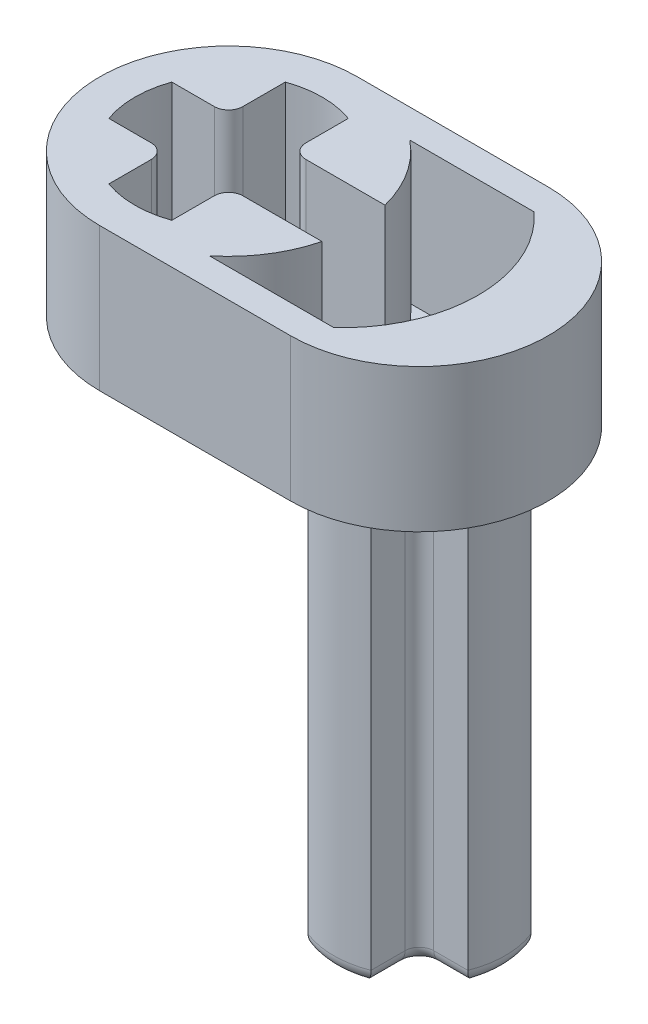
ISO-10303-21;
HEADER;
FILE_DESCRIPTION(('STEP AP214'),'2;1');
FILE_NAME('part.step','',(''),(''),'','','');
FILE_SCHEMA(('AUTOMOTIVE_DESIGN { 1 0 10303 214 1 1 1 1 }'));
ENDSEC;
DATA;
#1=APPLICATION_CONTEXT('core data for automotive mechanical design processes');
#2=APPLICATION_PROTOCOL_DEFINITION('international standard','automotive_design',2000,#1);
#3=PRODUCT_CONTEXT('',#1,'mechanical');
#4=PRODUCT('Part','Part','',(#3));
#5=PRODUCT_RELATED_PRODUCT_CATEGORY('part','',(#4));
#6=PRODUCT_DEFINITION_FORMATION('','',#4);
#7=PRODUCT_DEFINITION_CONTEXT('part definition',#1,'design');
#8=PRODUCT_DEFINITION('design','',#6,#7);
#9=PRODUCT_DEFINITION_SHAPE('','',#8);
#10=(LENGTH_UNIT() NAMED_UNIT(*) SI_UNIT(.MILLI.,.METRE.));
#11=(NAMED_UNIT(*) PLANE_ANGLE_UNIT() SI_UNIT($,.RADIAN.));
#12=(NAMED_UNIT(*) SI_UNIT($,.STERADIAN.) SOLID_ANGLE_UNIT());
#13=UNCERTAINTY_MEASURE_WITH_UNIT(LENGTH_MEASURE(1.E-05),#10,'distance_accuracy_value','');
#14=(GEOMETRIC_REPRESENTATION_CONTEXT(3) GLOBAL_UNCERTAINTY_ASSIGNED_CONTEXT((#13)) GLOBAL_UNIT_ASSIGNED_CONTEXT((#10,
#11,#12)) REPRESENTATION_CONTEXT('',''));
#15=CARTESIAN_POINT('',(0.,0.,0.));
#16=DIRECTION('',(0.,0.,1.));
#17=DIRECTION('',(1.,0.,0.));
#18=AXIS2_PLACEMENT_3D('',#15,#16,#17);
#19=CARTESIAN_POINT('',(-0.454132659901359,0.704835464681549,12.533));
#20=DIRECTION('',(0.,-1.,0.));
#21=DIRECTION('',(1.,0.,0.));
#22=AXIS2_PLACEMENT_3D('',#19,#20,#21);
#23=CYLINDRICAL_SURFACE('',#22,2.4);
#24=CARTESIAN_POINT('',(-0.454132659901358,-3.24516453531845,12.533));
#25=DIRECTION('',(0.,-1.,0.));
#26=DIRECTION('',(0.,0.,-1.));
#27=AXIS2_PLACEMENT_3D('',#24,#25,#26);
#28=CIRCLE('',#27,2.4);
#29=CARTESIAN_POINT('',(-1.33413265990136,-3.24516453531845,14.7658457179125));
#30=VERTEX_POINT('',#29);
#31=CARTESIAN_POINT('',(0.425867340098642,-3.24516453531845,14.7658457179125));
#32=VERTEX_POINT('',#31);
#33=EDGE_CURVE('P0_E613',#30,#32,#28,.F.);
#34=ORIENTED_EDGE('',*,*,#33,.F.);
#35=DIRECTION('',(0.,1.,0.));
#36=VECTOR('',#35,1.);
#37=CARTESIAN_POINT('',(-1.33413265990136,-15.2951645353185,14.7658457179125));
#38=LINE('',#37,#36);
#39=CARTESIAN_POINT('',(-1.33413265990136,-14.8951645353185,14.7658457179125));
#40=VERTEX_POINT('',#39);
#41=EDGE_CURVE('P0_E252',#40,#30,#38,.T.);
#42=ORIENTED_EDGE('',*,*,#41,.F.);
#43=CARTESIAN_POINT('',(-0.454132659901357,-14.8951645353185,12.533));
#44=DIRECTION('',(0.,-1.,0.));
#45=DIRECTION('',(1.,0.,0.));
#46=AXIS2_PLACEMENT_3D('',#43,#44,#45);
#47=CIRCLE('',#46,2.4);
#48=CARTESIAN_POINT('',(0.425867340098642,-14.8951645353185,14.7658457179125));
#49=VERTEX_POINT('',#48);
#50=EDGE_CURVE('P0_E341',#40,#49,#47,.F.);
#51=ORIENTED_EDGE('',*,*,#50,.T.);
#52=DIRECTION('',(0.,1.,0.));
#53=VECTOR('',#52,1.);
#54=CARTESIAN_POINT('',(0.425867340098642,-15.2951645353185,14.7658457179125));
#55=LINE('',#54,#53);
#56=EDGE_CURVE('P0_E546',#49,#32,#55,.T.);
#57=ORIENTED_EDGE('',*,*,#56,.T.);
#58=EDGE_LOOP('',(#34,#42,#51,#57));
#59=FACE_BOUND('',#58,.T.);
#60=ADVANCED_FACE('P0_F32',(#59),#23,.T.);
#61=DIRECTION('',(0.,1.,0.));
#62=VECTOR('',#61,1.);
#63=CARTESIAN_POINT('',(1.7787130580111,-15.2951645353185,13.413));
#64=LINE('',#63,#62);
#65=CARTESIAN_POINT('',(1.7787130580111,-14.8951645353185,13.413));
#66=VERTEX_POINT('',#65);
#67=CARTESIAN_POINT('',(1.7787130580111,0.30483546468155,13.413));
#68=VERTEX_POINT('',#67);
#69=EDGE_CURVE('P0_E516',#66,#68,#64,.T.);
#70=ORIENTED_EDGE('',*,*,#69,.F.);
#71=CARTESIAN_POINT('',(-0.454132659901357,-14.8951645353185,12.533));
#72=DIRECTION('',(0.,-1.,0.));
#73=DIRECTION('',(1.,0.,0.));
#74=AXIS2_PLACEMENT_3D('',#71,#72,#73);
#75=CIRCLE('',#74,2.4);
#76=CARTESIAN_POINT('',(1.7787130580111,-14.8951645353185,11.653));
#77=VERTEX_POINT('',#76);
#78=EDGE_CURVE('P0_E314',#66,#77,#75,.F.);
#79=ORIENTED_EDGE('',*,*,#78,.T.);
#80=DIRECTION('',(0.,1.,0.));
#81=VECTOR('',#80,1.);
#82=CARTESIAN_POINT('',(1.7787130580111,-15.2951645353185,11.653));
#83=LINE('',#82,#81);
#84=CARTESIAN_POINT('',(1.7787130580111,0.30483546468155,11.653));
#85=VERTEX_POINT('',#84);
#86=EDGE_CURVE('P0_E249',#77,#85,#83,.T.);
#87=ORIENTED_EDGE('',*,*,#86,.T.);
#88=CARTESIAN_POINT('',(-0.454132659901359,0.30483546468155,12.533));
#89=DIRECTION('',(0.,1.,0.));
#90=DIRECTION('',(-1.,0.,0.));
#91=AXIS2_PLACEMENT_3D('',#88,#89,#90);
#92=CIRCLE('',#91,2.4);
#93=EDGE_CURVE('P0_E312',#85,#68,#92,.F.);
#94=ORIENTED_EDGE('',*,*,#93,.T.);
#95=EDGE_LOOP('',(#70,#79,#87,#94));
#96=FACE_BOUND('',#95,.T.);
#97=ADVANCED_FACE('P0_F603',(#96),#23,.T.);
#98=CARTESIAN_POINT('',(-0.454132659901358,-3.24516453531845,12.533));
#99=DIRECTION('',(0.,-1.,0.));
#100=DIRECTION('',(0.,0.,-1.));
#101=AXIS2_PLACEMENT_3D('',#98,#99,#100);
#102=CIRCLE('',#101,2.4);
#103=CARTESIAN_POINT('',(0.425867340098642,-3.24516453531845,10.3001542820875));
#104=VERTEX_POINT('',#103);
#105=CARTESIAN_POINT('',(-1.33413265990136,-3.24516453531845,10.3001542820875));
#106=VERTEX_POINT('',#105);
#107=EDGE_CURVE('P0_E545',#104,#106,#102,.F.);
#108=ORIENTED_EDGE('',*,*,#107,.F.);
#109=DIRECTION('',(0.,1.,0.));
#110=VECTOR('',#109,1.);
#111=CARTESIAN_POINT('',(0.425867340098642,-15.2951645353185,10.3001542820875));
#112=LINE('',#111,#110);
#113=CARTESIAN_POINT('',(0.425867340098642,-14.8951645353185,10.3001542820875));
#114=VERTEX_POINT('',#113);
#115=EDGE_CURVE('P0_E255',#114,#104,#112,.T.);
#116=ORIENTED_EDGE('',*,*,#115,.F.);
#117=CARTESIAN_POINT('',(-0.454132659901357,-14.8951645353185,12.533));
#118=DIRECTION('',(0.,-1.,0.));
#119=DIRECTION('',(1.,0.,0.));
#120=AXIS2_PLACEMENT_3D('',#117,#118,#119);
#121=CIRCLE('',#120,2.4);
#122=CARTESIAN_POINT('',(-1.33413265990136,-14.8951645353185,10.3001542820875));
#123=VERTEX_POINT('',#122);
#124=EDGE_CURVE('P0_E316',#114,#123,#121,.F.);
#125=ORIENTED_EDGE('',*,*,#124,.T.);
#126=DIRECTION('',(0.,1.,0.));
#127=VECTOR('',#126,1.);
#128=CARTESIAN_POINT('',(-1.33413265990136,-15.2951645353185,10.3001542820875));
#129=LINE('',#128,#127);
#130=EDGE_CURVE('P0_E248',#123,#106,#129,.T.);
#131=ORIENTED_EDGE('',*,*,#130,.T.);
#132=EDGE_LOOP('',(#108,#116,#125,#131));
#133=FACE_BOUND('',#132,.T.);
#134=ADVANCED_FACE('P0_F543',(#133),#23,.T.);
#135=CARTESIAN_POINT('',(-0.454132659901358,-3.24516453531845,12.533));
#136=DIRECTION('',(0.,-1.,0.));
#137=DIRECTION('',(0.,0.,-1.));
#138=AXIS2_PLACEMENT_3D('',#135,#136,#137);
#139=CIRCLE('',#138,2.4);
#140=CARTESIAN_POINT('',(-2.68697837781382,-3.24516453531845,11.653));
#141=VERTEX_POINT('',#140);
#142=CARTESIAN_POINT('',(-2.68697837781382,-3.24516453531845,13.413));
#143=VERTEX_POINT('',#142);
#144=EDGE_CURVE('P0_E225',#141,#143,#139,.F.);
#145=ORIENTED_EDGE('',*,*,#144,.F.);
#146=DIRECTION('',(0.,1.,0.));
#147=VECTOR('',#146,1.);
#148=CARTESIAN_POINT('',(-2.68697837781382,-15.2951645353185,11.653));
#149=LINE('',#148,#147);
#150=CARTESIAN_POINT('',(-2.68697837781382,-14.8951645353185,11.653));
#151=VERTEX_POINT('',#150);
#152=EDGE_CURVE('P0_E238',#151,#141,#149,.T.);
#153=ORIENTED_EDGE('',*,*,#152,.F.);
#154=CARTESIAN_POINT('',(-0.454132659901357,-14.8951645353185,12.533));
#155=DIRECTION('',(0.,-1.,0.));
#156=DIRECTION('',(1.,0.,0.));
#157=AXIS2_PLACEMENT_3D('',#154,#155,#156);
#158=CIRCLE('',#157,2.4);
#159=CARTESIAN_POINT('',(-2.68697837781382,-14.8951645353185,13.413));
#160=VERTEX_POINT('',#159);
#161=EDGE_CURVE('P0_E336',#151,#160,#158,.F.);
#162=ORIENTED_EDGE('',*,*,#161,.T.);
#163=DIRECTION('',(0.,1.,0.));
#164=VECTOR('',#163,1.);
#165=CARTESIAN_POINT('',(-2.68697837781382,-15.2951645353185,13.413));
#166=LINE('',#165,#164);
#167=EDGE_CURVE('P0_E241',#160,#143,#166,.T.);
#168=ORIENTED_EDGE('',*,*,#167,.T.);
#169=EDGE_LOOP('',(#145,#153,#162,#168));
#170=FACE_BOUND('',#169,.T.);
#171=ADVANCED_FACE('P0_F236',(#170),#23,.T.);
#172=CARTESIAN_POINT('',(1.94586734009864,0.704835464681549,12.533));
#173=DIRECTION('',(0.,1.,0.));
#174=DIRECTION('',(-1.,0.,0.));
#175=AXIS2_PLACEMENT_3D('',#172,#173,#174);
#176=PLANE('',#175);
#177=CARTESIAN_POINT('',(-2.5994958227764,0.70483546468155,12.533));
#178=DIRECTION('',(0.,1.,0.));
#179=DIRECTION('',(0.,0.,1.));
#180=AXIS2_PLACEMENT_3D('',#177,#178,#179);
#181=CIRCLE('',#180,3.78689445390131);
#182=CARTESIAN_POINT('',(1.15685474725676,0.70483546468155,13.013));
#183=VERTEX_POINT('',#182);
#184=CARTESIAN_POINT('',(1.15685474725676,0.70483546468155,12.053));
#185=VERTEX_POINT('',#184);
#186=EDGE_CURVE('P0_E685',#183,#185,#181,.T.);
#187=ORIENTED_EDGE('',*,*,#186,.F.);
#188=DIRECTION('',(-1.,0.,0.));
#189=VECTOR('',#188,1.);
#190=CARTESIAN_POINT('',(1.7787130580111,0.704835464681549,13.013));
#191=LINE('',#190,#189);
#192=CARTESIAN_POINT('',(1.4874131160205,0.704835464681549,13.013));
#193=VERTEX_POINT('',#192);
#194=EDGE_CURVE('P0_E352',#183,#193,#191,.F.);
#195=ORIENTED_EDGE('',*,*,#194,.T.);
#196=CARTESIAN_POINT('',(-0.454132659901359,0.704835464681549,12.533));
#197=DIRECTION('',(0.,1.,0.));
#198=DIRECTION('',(-1.,0.,0.));
#199=AXIS2_PLACEMENT_3D('',#196,#197,#198);
#200=CIRCLE('',#199,2.);
#201=CARTESIAN_POINT('',(1.4874131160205,0.704835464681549,12.053));
#202=VERTEX_POINT('',#201);
#203=EDGE_CURVE('P0_E60',#193,#202,#200,.T.);
#204=ORIENTED_EDGE('',*,*,#203,.T.);
#205=DIRECTION('',(1.,0.,0.));
#206=VECTOR('',#205,1.);
#207=CARTESIAN_POINT('',(0.425867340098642,0.704835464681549,12.053));
#208=LINE('',#207,#206);
#209=EDGE_CURVE('P0_E355',#202,#185,#208,.F.);
#210=ORIENTED_EDGE('',*,*,#209,.T.);
#211=EDGE_LOOP('',(#187,#195,#204,#210));
#212=FACE_BOUND('',#211,.T.);
#213=ADVANCED_FACE('P0_F596',(#212),#176,.T.);
#214=CARTESIAN_POINT('',(-0.454132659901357,-15.2951645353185,12.533));
#215=DIRECTION('',(0.,-1.,0.));
#216=DIRECTION('',(1.,0.,0.));
#217=AXIS2_PLACEMENT_3D('',#214,#215,#216);
#218=PLANE('',#217);
#219=CARTESIAN_POINT('',(-1.73413265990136,-15.2951645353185,11.253));
#220=DIRECTION('',(0.,-1.,0.));
#221=DIRECTION('',(1.,0.,0.));
#222=AXIS2_PLACEMENT_3D('',#219,#220,#221);
#223=CIRCLE('',#222,0.8);
#224=CARTESIAN_POINT('',(-0.934132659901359,-15.2951645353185,11.253));
#225=VERTEX_POINT('',#224);
#226=CARTESIAN_POINT('',(-1.73413265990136,-15.2951645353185,12.053));
#227=VERTEX_POINT('',#226);
#228=EDGE_CURVE('P0_E294',#225,#227,#223,.T.);
#229=ORIENTED_EDGE('',*,*,#228,.F.);
#230=DIRECTION('',(0.,0.,-1.));
#231=VECTOR('',#230,1.);
#232=CARTESIAN_POINT('',(-0.93413265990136,-15.2951645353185,10.3001542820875));
#233=LINE('',#232,#231);
#234=CARTESIAN_POINT('',(-0.934132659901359,-15.2951645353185,10.5914542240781));
#235=VERTEX_POINT('',#234);
#236=EDGE_CURVE('P0_E297',#225,#235,#233,.T.);
#237=ORIENTED_EDGE('',*,*,#236,.T.);
#238=CARTESIAN_POINT('',(-0.454132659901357,-15.2951645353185,12.533));
#239=DIRECTION('',(0.,-1.,0.));
#240=DIRECTION('',(1.,0.,0.));
#241=AXIS2_PLACEMENT_3D('',#238,#239,#240);
#242=CIRCLE('',#241,2.);
#243=CARTESIAN_POINT('',(0.0258673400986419,-15.2951645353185,10.5914542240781));
#244=VERTEX_POINT('',#243);
#245=EDGE_CURVE('P0_E292',#235,#244,#242,.T.);
#246=ORIENTED_EDGE('',*,*,#245,.T.);
#247=DIRECTION('',(0.,0.,1.));
#248=VECTOR('',#247,1.);
#249=CARTESIAN_POINT('',(0.0258673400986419,-15.2951645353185,11.653));
#250=LINE('',#249,#248);
#251=CARTESIAN_POINT('',(0.0258673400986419,-15.2951645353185,11.253));
#252=VERTEX_POINT('',#251);
#253=EDGE_CURVE('P0_E287',#244,#252,#250,.T.);
#254=ORIENTED_EDGE('',*,*,#253,.T.);
#255=CARTESIAN_POINT('',(0.825867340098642,-15.2951645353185,11.253));
#256=DIRECTION('',(0.,-1.,0.));
#257=DIRECTION('',(1.,0.,0.));
#258=AXIS2_PLACEMENT_3D('',#255,#256,#257);
#259=CIRCLE('',#258,0.8);
#260=CARTESIAN_POINT('',(0.825867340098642,-15.2951645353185,12.053));
#261=VERTEX_POINT('',#260);
#262=EDGE_CURVE('P0_E284',#261,#252,#259,.T.);
#263=ORIENTED_EDGE('',*,*,#262,.F.);
#264=DIRECTION('',(1.,0.,0.));
#265=VECTOR('',#264,1.);
#266=CARTESIAN_POINT('',(1.7787130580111,-15.2951645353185,12.053));
#267=LINE('',#266,#265);
#268=CARTESIAN_POINT('',(1.4874131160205,-15.2951645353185,12.053));
#269=VERTEX_POINT('',#268);
#270=EDGE_CURVE('P0_E282',#261,#269,#267,.T.);
#271=ORIENTED_EDGE('',*,*,#270,.T.);
#272=CARTESIAN_POINT('',(-0.454132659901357,-15.2951645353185,12.533));
#273=DIRECTION('',(0.,-1.,0.));
#274=DIRECTION('',(1.,0.,0.));
#275=AXIS2_PLACEMENT_3D('',#272,#273,#274);
#276=CIRCLE('',#275,2.);
#277=CARTESIAN_POINT('',(1.4874131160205,-15.2951645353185,13.013));
#278=VERTEX_POINT('',#277);
#279=EDGE_CURVE('P0_E280',#269,#278,#276,.T.);
#280=ORIENTED_EDGE('',*,*,#279,.T.);
#281=DIRECTION('',(-1.,0.,0.));
#282=VECTOR('',#281,1.);
#283=CARTESIAN_POINT('',(0.425867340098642,-15.2951645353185,13.013));
#284=LINE('',#283,#282);
#285=CARTESIAN_POINT('',(0.825867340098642,-15.2951645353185,13.013));
#286=VERTEX_POINT('',#285);
#287=EDGE_CURVE('P0_E278',#278,#286,#284,.T.);
#288=ORIENTED_EDGE('',*,*,#287,.T.);
#289=CARTESIAN_POINT('',(0.825867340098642,-15.2951645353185,13.813));
#290=DIRECTION('',(0.,-1.,0.));
#291=DIRECTION('',(1.,0.,0.));
#292=AXIS2_PLACEMENT_3D('',#289,#290,#291);
#293=CIRCLE('',#292,0.8);
#294=CARTESIAN_POINT('',(0.025867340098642,-15.2951645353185,13.813));
#295=VERTEX_POINT('',#294);
#296=EDGE_CURVE('P0_E275',#295,#286,#293,.T.);
#297=ORIENTED_EDGE('',*,*,#296,.F.);
#298=DIRECTION('',(0.,0.,1.));
#299=VECTOR('',#298,1.);
#300=CARTESIAN_POINT('',(0.0258673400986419,-15.2951645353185,14.7658457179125));
#301=LINE('',#300,#299);
#302=CARTESIAN_POINT('',(0.0258673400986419,-15.2951645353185,14.4745457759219));
#303=VERTEX_POINT('',#302);
#304=EDGE_CURVE('P0_E273',#295,#303,#301,.T.);
#305=ORIENTED_EDGE('',*,*,#304,.T.);
#306=CARTESIAN_POINT('',(-0.454132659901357,-15.2951645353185,12.533));
#307=DIRECTION('',(0.,-1.,0.));
#308=DIRECTION('',(1.,0.,0.));
#309=AXIS2_PLACEMENT_3D('',#306,#307,#308);
#310=CIRCLE('',#309,2.);
#311=CARTESIAN_POINT('',(-0.934132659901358,-15.2951645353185,14.4745457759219));
#312=VERTEX_POINT('',#311);
#313=EDGE_CURVE('P0_E269',#303,#312,#310,.T.);
#314=ORIENTED_EDGE('',*,*,#313,.T.);
#315=DIRECTION('',(0.,0.,-1.));
#316=VECTOR('',#315,1.);
#317=CARTESIAN_POINT('',(-0.934132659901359,-15.2951645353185,13.413));
#318=LINE('',#317,#316);
#319=CARTESIAN_POINT('',(-0.934132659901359,-15.2951645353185,13.813));
#320=VERTEX_POINT('',#319);
#321=EDGE_CURVE('P0_E267',#312,#320,#318,.T.);
#322=ORIENTED_EDGE('',*,*,#321,.T.);
#323=CARTESIAN_POINT('',(-1.73413265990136,-15.2951645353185,13.813));
#324=DIRECTION('',(0.,-1.,0.));
#325=DIRECTION('',(1.,0.,0.));
#326=AXIS2_PLACEMENT_3D('',#323,#324,#325);
#327=CIRCLE('',#326,0.8);
#328=CARTESIAN_POINT('',(-1.73413265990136,-15.2951645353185,13.013));
#329=VERTEX_POINT('',#328);
#330=EDGE_CURVE('P0_E264',#329,#320,#327,.T.);
#331=ORIENTED_EDGE('',*,*,#330,.F.);
#332=DIRECTION('',(-1.,0.,0.));
#333=VECTOR('',#332,1.);
#334=CARTESIAN_POINT('',(-2.68697837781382,-15.2951645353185,13.013));
#335=LINE('',#334,#333);
#336=CARTESIAN_POINT('',(-2.39567843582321,-15.2951645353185,13.013));
#337=VERTEX_POINT('',#336);
#338=EDGE_CURVE('P0_E260',#329,#337,#335,.T.);
#339=ORIENTED_EDGE('',*,*,#338,.T.);
#340=CARTESIAN_POINT('',(-0.454132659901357,-15.2951645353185,12.533));
#341=DIRECTION('',(0.,-1.,0.));
#342=DIRECTION('',(1.,0.,0.));
#343=AXIS2_PLACEMENT_3D('',#340,#341,#342);
#344=CIRCLE('',#343,2.);
#345=CARTESIAN_POINT('',(-2.39567843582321,-15.2951645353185,12.053));
#346=VERTEX_POINT('',#345);
#347=EDGE_CURVE('P0_E271',#337,#346,#344,.T.);
#348=ORIENTED_EDGE('',*,*,#347,.T.);
#349=DIRECTION('',(1.,0.,0.));
#350=VECTOR('',#349,1.);
#351=CARTESIAN_POINT('',(-1.33413265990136,-15.2951645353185,12.053));
#352=LINE('',#351,#350);
#353=EDGE_CURVE('P0_E290',#346,#227,#352,.T.);
#354=ORIENTED_EDGE('',*,*,#353,.T.);
#355=EDGE_LOOP('',(#229,#237,#246,#254,#263,#271,#280,#288,#297,#305,#314,#322,#331,#339,#348,#354));
#356=FACE_BOUND('',#355,.T.);
#357=ADVANCED_FACE('P0_F589',(#356),#218,.T.);
#358=CARTESIAN_POINT('',(-1.33413265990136,-15.2951645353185,13.413));
#359=DIRECTION('',(0.,0.,-1.));
#360=DIRECTION('',(-1.,0.,0.));
#361=AXIS2_PLACEMENT_3D('',#358,#359,#360);
#362=PLANE('',#361);
#363=DIRECTION('',(0.,1.,0.));
#364=VECTOR('',#363,1.);
#365=CARTESIAN_POINT('',(-1.73413265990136,0.704835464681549,13.413));
#366=LINE('',#365,#364);
#367=CARTESIAN_POINT('',(-1.73413265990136,-14.8951645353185,13.413));
#368=VERTEX_POINT('',#367);
#369=CARTESIAN_POINT('',(-1.73413265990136,-3.24516453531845,13.413));
#370=VERTEX_POINT('',#369);
#371=EDGE_CURVE('P0_E347',#368,#370,#366,.T.);
#372=ORIENTED_EDGE('',*,*,#371,.T.);
#373=DIRECTION('',(-1.,0.,0.));
#374=VECTOR('',#373,1.);
#375=CARTESIAN_POINT('',(-1.33413265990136,-3.24516453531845,13.413));
#376=LINE('',#375,#374);
#377=EDGE_CURVE('P0_E243',#370,#143,#376,.T.);
#378=ORIENTED_EDGE('',*,*,#377,.T.);
#379=ORIENTED_EDGE('',*,*,#167,.F.);
#380=DIRECTION('',(-1.,0.,0.));
#381=VECTOR('',#380,1.);
#382=CARTESIAN_POINT('',(-1.33413265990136,-14.8951645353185,13.413));
#383=LINE('',#382,#381);
#384=EDGE_CURVE('P0_E350',#160,#368,#383,.F.);
#385=ORIENTED_EDGE('',*,*,#384,.T.);
#386=EDGE_LOOP('',(#372,#378,#379,#385));
#387=FACE_BOUND('',#386,.T.);
#388=ADVANCED_FACE('P0_F586',(#387),#362,.F.);
#389=CARTESIAN_POINT('',(-1.33413265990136,-15.2951645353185,14.7658457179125));
#390=DIRECTION('',(1.,0.,0.));
#391=DIRECTION('',(0.,0.,-1.));
#392=AXIS2_PLACEMENT_3D('',#389,#390,#391);
#393=PLANE('',#392);
#394=ORIENTED_EDGE('',*,*,#41,.T.);
#395=DIRECTION('',(0.,0.,-1.));
#396=VECTOR('',#395,1.);
#397=CARTESIAN_POINT('',(-1.33413265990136,-3.24516453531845,14.7658457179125));
#398=LINE('',#397,#396);
#399=CARTESIAN_POINT('',(-1.33413265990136,-3.24516453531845,13.813));
#400=VERTEX_POINT('',#399);
#401=EDGE_CURVE('P0_E617',#30,#400,#398,.T.);
#402=ORIENTED_EDGE('',*,*,#401,.T.);
#403=DIRECTION('',(0.,1.,0.));
#404=VECTOR('',#403,1.);
#405=CARTESIAN_POINT('',(-1.33413265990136,-15.2951645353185,13.813));
#406=LINE('',#405,#404);
#407=CARTESIAN_POINT('',(-1.33413265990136,-14.8951645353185,13.813));
#408=VERTEX_POINT('',#407);
#409=EDGE_CURVE('P0_E343',#400,#408,#406,.F.);
#410=ORIENTED_EDGE('',*,*,#409,.T.);
#411=DIRECTION('',(0.,0.,-1.));
#412=VECTOR('',#411,1.);
#413=CARTESIAN_POINT('',(-1.33413265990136,-14.8951645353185,14.7658457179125));
#414=LINE('',#413,#412);
#415=EDGE_CURVE('P0_E345',#408,#40,#414,.F.);
#416=ORIENTED_EDGE('',*,*,#415,.T.);
#417=EDGE_LOOP('',(#394,#402,#410,#416));
#418=FACE_BOUND('',#417,.T.);
#419=ADVANCED_FACE('P0_F582',(#418),#393,.F.);
#420=CARTESIAN_POINT('',(-1.33413265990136,-15.2951645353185,11.653));
#421=DIRECTION('',(1.,0.,0.));
#422=DIRECTION('',(0.,0.,-1.));
#423=AXIS2_PLACEMENT_3D('',#420,#421,#422);
#424=PLANE('',#423);
#425=DIRECTION('',(0.,1.,0.));
#426=VECTOR('',#425,1.);
#427=CARTESIAN_POINT('',(-1.33413265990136,0.704835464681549,11.253));
#428=LINE('',#427,#426);
#429=CARTESIAN_POINT('',(-1.33413265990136,-14.8951645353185,11.253));
#430=VERTEX_POINT('',#429);
#431=CARTESIAN_POINT('',(-1.33413265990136,-3.24516453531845,11.253));
#432=VERTEX_POINT('',#431);
#433=EDGE_CURVE('P0_E331',#430,#432,#428,.T.);
#434=ORIENTED_EDGE('',*,*,#433,.T.);
#435=DIRECTION('',(0.,0.,-1.));
#436=VECTOR('',#435,1.);
#437=CARTESIAN_POINT('',(-1.33413265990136,-3.24516453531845,11.653));
#438=LINE('',#437,#436);
#439=EDGE_CURVE('P0_E676',#432,#106,#438,.T.);
#440=ORIENTED_EDGE('',*,*,#439,.T.);
#441=ORIENTED_EDGE('',*,*,#130,.F.);
#442=DIRECTION('',(0.,0.,-1.));
#443=VECTOR('',#442,1.);
#444=CARTESIAN_POINT('',(-1.33413265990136,-14.8951645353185,11.653));
#445=LINE('',#444,#443);
#446=EDGE_CURVE('P0_E334',#123,#430,#445,.F.);
#447=ORIENTED_EDGE('',*,*,#446,.T.);
#448=EDGE_LOOP('',(#434,#440,#441,#447));
#449=FACE_BOUND('',#448,.T.);
#450=ADVANCED_FACE('P0_F579',(#449),#424,.F.);
#451=CARTESIAN_POINT('',(-2.68697837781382,-15.2951645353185,11.653));
#452=DIRECTION('',(0.,0.,1.));
#453=DIRECTION('',(1.,0.,0.));
#454=AXIS2_PLACEMENT_3D('',#451,#452,#453);
#455=PLANE('',#454);
#456=ORIENTED_EDGE('',*,*,#152,.T.);
#457=DIRECTION('',(1.,0.,0.));
#458=VECTOR('',#457,1.);
#459=CARTESIAN_POINT('',(-2.68697837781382,-3.24516453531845,11.653));
#460=LINE('',#459,#458);
#461=CARTESIAN_POINT('',(-1.73413265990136,-3.24516453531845,11.653));
#462=VERTEX_POINT('',#461);
#463=EDGE_CURVE('P0_E222',#141,#462,#460,.T.);
#464=ORIENTED_EDGE('',*,*,#463,.T.);
#465=DIRECTION('',(0.,1.,0.));
#466=VECTOR('',#465,1.);
#467=CARTESIAN_POINT('',(-1.73413265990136,-15.2951645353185,11.653));
#468=LINE('',#467,#466);
#469=CARTESIAN_POINT('',(-1.73413265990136,-14.8951645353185,11.653));
#470=VERTEX_POINT('',#469);
#471=EDGE_CURVE('P0_E338',#462,#470,#468,.F.);
#472=ORIENTED_EDGE('',*,*,#471,.T.);
#473=DIRECTION('',(1.,0.,0.));
#474=VECTOR('',#473,1.);
#475=CARTESIAN_POINT('',(-2.68697837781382,-14.8951645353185,11.653));
#476=LINE('',#475,#474);
#477=EDGE_CURVE('P0_E247',#470,#151,#476,.F.);
#478=ORIENTED_EDGE('',*,*,#477,.T.);
#479=EDGE_LOOP('',(#456,#464,#472,#478));
#480=FACE_BOUND('',#479,.T.);
#481=ADVANCED_FACE('P0_F245',(#480),#455,.F.);
#482=CARTESIAN_POINT('',(0.425867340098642,-15.2951645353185,11.653));
#483=DIRECTION('',(0.,0.,1.));
#484=DIRECTION('',(1.,0.,0.));
#485=AXIS2_PLACEMENT_3D('',#482,#483,#484);
#486=PLANE('',#485);
#487=DIRECTION('',(0.,1.,0.));
#488=VECTOR('',#487,1.);
#489=CARTESIAN_POINT('',(0.825867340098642,0.704835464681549,11.653));
#490=LINE('',#489,#488);
#491=CARTESIAN_POINT('',(0.825867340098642,-14.8951645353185,11.653));
#492=VERTEX_POINT('',#491);
#493=CARTESIAN_POINT('',(0.825867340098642,-3.24516453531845,11.653));
#494=VERTEX_POINT('',#493);
#495=EDGE_CURVE('P0_E304',#492,#494,#490,.T.);
#496=ORIENTED_EDGE('',*,*,#495,.T.);
#497=DIRECTION('',(1.,0.,0.));
#498=VECTOR('',#497,1.);
#499=CARTESIAN_POINT('',(0.425867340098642,-3.24516453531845,11.653));
#500=LINE('',#499,#498);
#501=CARTESIAN_POINT('',(1.08373232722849,-3.24516453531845,11.653));
#502=VERTEX_POINT('',#501);
#503=EDGE_CURVE('P0_E52',#494,#502,#500,.T.);
#504=ORIENTED_EDGE('',*,*,#503,.T.);
#505=DIRECTION('',(0.,1.,0.));
#506=VECTOR('',#505,1.);
#507=CARTESIAN_POINT('',(1.08373232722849,-10.7000468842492,11.653));
#508=LINE('',#507,#506);
#509=CARTESIAN_POINT('',(1.08373232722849,0.30483546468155,11.653));
#510=VERTEX_POINT('',#509);
#511=EDGE_CURVE('P0_E242',#502,#510,#508,.T.);
#512=ORIENTED_EDGE('',*,*,#511,.T.);
#513=DIRECTION('',(1.,0.,0.));
#514=VECTOR('',#513,1.);
#515=CARTESIAN_POINT('',(1.7787130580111,0.30483546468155,11.653));
#516=LINE('',#515,#514);
#517=EDGE_CURVE('P0_E307',#510,#85,#516,.T.);
#518=ORIENTED_EDGE('',*,*,#517,.T.);
#519=ORIENTED_EDGE('',*,*,#86,.F.);
#520=DIRECTION('',(1.,0.,0.));
#521=VECTOR('',#520,1.);
#522=CARTESIAN_POINT('',(0.425867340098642,-14.8951645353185,11.653));
#523=LINE('',#522,#521);
#524=EDGE_CURVE('P0_E309',#77,#492,#523,.F.);
#525=ORIENTED_EDGE('',*,*,#524,.T.);
#526=EDGE_LOOP('',(#496,#504,#512,#518,#519,#525));
#527=FACE_BOUND('',#526,.T.);
#528=ADVANCED_FACE('P0_F523',(#527),#486,.F.);
#529=CARTESIAN_POINT('',(0.425867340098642,-15.2951645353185,10.3001542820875));
#530=DIRECTION('',(-1.,0.,0.));
#531=DIRECTION('',(0.,0.,1.));
#532=AXIS2_PLACEMENT_3D('',#529,#530,#531);
#533=PLANE('',#532);
#534=ORIENTED_EDGE('',*,*,#115,.T.);
#535=DIRECTION('',(0.,0.,1.));
#536=VECTOR('',#535,1.);
#537=CARTESIAN_POINT('',(0.425867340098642,-3.24516453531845,10.3001542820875));
#538=LINE('',#537,#536);
#539=CARTESIAN_POINT('',(0.425867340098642,-3.24516453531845,11.253));
#540=VERTEX_POINT('',#539);
#541=EDGE_CURVE('P0_E681',#104,#540,#538,.T.);
#542=ORIENTED_EDGE('',*,*,#541,.T.);
#543=DIRECTION('',(0.,1.,0.));
#544=VECTOR('',#543,1.);
#545=CARTESIAN_POINT('',(0.425867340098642,-15.2951645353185,11.253));
#546=LINE('',#545,#544);
#547=CARTESIAN_POINT('',(0.425867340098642,-14.8951645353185,11.253));
#548=VERTEX_POINT('',#547);
#549=EDGE_CURVE('P0_E299',#540,#548,#546,.F.);
#550=ORIENTED_EDGE('',*,*,#549,.T.);
#551=DIRECTION('',(0.,0.,1.));
#552=VECTOR('',#551,1.);
#553=CARTESIAN_POINT('',(0.425867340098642,-14.8951645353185,10.3001542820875));
#554=LINE('',#553,#552);
#555=EDGE_CURVE('P0_E301',#548,#114,#554,.F.);
#556=ORIENTED_EDGE('',*,*,#555,.T.);
#557=EDGE_LOOP('',(#534,#542,#550,#556));
#558=FACE_BOUND('',#557,.T.);
#559=ADVANCED_FACE('P0_F540',(#558),#533,.F.);
#560=CARTESIAN_POINT('',(0.425867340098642,-15.2951645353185,13.413));
#561=DIRECTION('',(-1.,0.,0.));
#562=DIRECTION('',(0.,0.,1.));
#563=AXIS2_PLACEMENT_3D('',#560,#561,#562);
#564=PLANE('',#563);
#565=DIRECTION('',(0.,1.,0.));
#566=VECTOR('',#565,1.);
#567=CARTESIAN_POINT('',(0.425867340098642,0.704835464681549,13.813));
#568=LINE('',#567,#566);
#569=CARTESIAN_POINT('',(0.425867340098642,-14.8951645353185,13.813));
#570=VERTEX_POINT('',#569);
#571=CARTESIAN_POINT('',(0.425867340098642,-3.24516453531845,13.813));
#572=VERTEX_POINT('',#571);
#573=EDGE_CURVE('P0_E325',#570,#572,#568,.T.);
#574=ORIENTED_EDGE('',*,*,#573,.T.);
#575=DIRECTION('',(0.,0.,1.));
#576=VECTOR('',#575,1.);
#577=CARTESIAN_POINT('',(0.425867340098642,-3.24516453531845,13.413));
#578=LINE('',#577,#576);
#579=EDGE_CURVE('P0_E618',#572,#32,#578,.T.);
#580=ORIENTED_EDGE('',*,*,#579,.T.);
#581=ORIENTED_EDGE('',*,*,#56,.F.);
#582=DIRECTION('',(0.,0.,1.));
#583=VECTOR('',#582,1.);
#584=CARTESIAN_POINT('',(0.425867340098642,-14.8951645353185,13.413));
#585=LINE('',#584,#583);
#586=EDGE_CURVE('P0_E328',#49,#570,#585,.F.);
#587=ORIENTED_EDGE('',*,*,#586,.T.);
#588=EDGE_LOOP('',(#574,#580,#581,#587));
#589=FACE_BOUND('',#588,.T.);
#590=ADVANCED_FACE('P0_F567',(#589),#564,.F.);
#591=CARTESIAN_POINT('',(1.7787130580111,-15.2951645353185,13.413));
#592=DIRECTION('',(0.,0.,-1.));
#593=DIRECTION('',(-1.,0.,0.));
#594=AXIS2_PLACEMENT_3D('',#591,#592,#593);
#595=PLANE('',#594);
#596=DIRECTION('',(0.,1.,0.));
#597=VECTOR('',#596,1.);
#598=CARTESIAN_POINT('',(1.08373232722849,-10.7000468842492,13.413));
#599=LINE('',#598,#597);
#600=CARTESIAN_POINT('',(1.08373232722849,0.30483546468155,13.413));
#601=VERTEX_POINT('',#600);
#602=CARTESIAN_POINT('',(1.08373232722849,-3.24516453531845,13.413));
#603=VERTEX_POINT('',#602);
#604=EDGE_CURVE('P0_E360',#601,#603,#599,.F.);
#605=ORIENTED_EDGE('',*,*,#604,.T.);
#606=DIRECTION('',(-1.,0.,0.));
#607=VECTOR('',#606,1.);
#608=CARTESIAN_POINT('',(1.7787130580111,-3.24516453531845,13.413));
#609=LINE('',#608,#607);
#610=CARTESIAN_POINT('',(0.825867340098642,-3.24516453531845,13.413));
#611=VERTEX_POINT('',#610);
#612=EDGE_CURVE('P0_E642',#603,#611,#609,.T.);
#613=ORIENTED_EDGE('',*,*,#612,.T.);
#614=DIRECTION('',(0.,1.,0.));
#615=VECTOR('',#614,1.);
#616=CARTESIAN_POINT('',(0.825867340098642,-15.2951645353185,13.413));
#617=LINE('',#616,#615);
#618=CARTESIAN_POINT('',(0.825867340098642,-14.8951645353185,13.413));
#619=VERTEX_POINT('',#618);
#620=EDGE_CURVE('P0_E318',#611,#619,#617,.F.);
#621=ORIENTED_EDGE('',*,*,#620,.T.);
#622=DIRECTION('',(-1.,0.,0.));
#623=VECTOR('',#622,1.);
#624=CARTESIAN_POINT('',(1.7787130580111,-14.8951645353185,13.413));
#625=LINE('',#624,#623);
#626=EDGE_CURVE('P0_E323',#619,#66,#625,.F.);
#627=ORIENTED_EDGE('',*,*,#626,.T.);
#628=ORIENTED_EDGE('',*,*,#69,.T.);
#629=DIRECTION('',(-1.,0.,0.));
#630=VECTOR('',#629,1.);
#631=CARTESIAN_POINT('',(0.425867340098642,0.30483546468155,13.413));
#632=LINE('',#631,#630);
#633=EDGE_CURVE('P0_E320',#68,#601,#632,.T.);
#634=ORIENTED_EDGE('',*,*,#633,.T.);
#635=EDGE_LOOP('',(#605,#613,#621,#627,#628,#634));
#636=FACE_BOUND('',#635,.T.);
#637=ADVANCED_FACE('P0_F570',(#636),#595,.F.);
#638=CARTESIAN_POINT('',(-1.73413265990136,-15.2951645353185,13.813));
#639=DIRECTION('',(0.,-1.,0.));
#640=DIRECTION('',(0.,0.,-1.));
#641=AXIS2_PLACEMENT_3D('',#638,#639,#640);
#642=CYLINDRICAL_SURFACE('',#641,0.4);
#643=ORIENTED_EDGE('',*,*,#409,.F.);
#644=CARTESIAN_POINT('',(-1.73413265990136,-3.24516453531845,13.813));
#645=DIRECTION('',(0.,-1.,0.));
#646=DIRECTION('',(0.,0.,-1.));
#647=AXIS2_PLACEMENT_3D('',#644,#645,#646);
#648=CIRCLE('',#647,0.4);
#649=EDGE_CURVE('P0_E649',#400,#370,#648,.F.);
#650=ORIENTED_EDGE('',*,*,#649,.T.);
#651=ORIENTED_EDGE('',*,*,#371,.F.);
#652=CARTESIAN_POINT('',(-1.73413265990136,-14.8951645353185,13.813));
#653=DIRECTION('',(0.,-1.,0.));
#654=DIRECTION('',(1.,0.,0.));
#655=AXIS2_PLACEMENT_3D('',#652,#653,#654);
#656=CIRCLE('',#655,0.4);
#657=EDGE_CURVE('P0_E514',#408,#368,#656,.F.);
#658=ORIENTED_EDGE('',*,*,#657,.F.);
#659=EDGE_LOOP('',(#643,#650,#651,#658));
#660=FACE_BOUND('',#659,.T.);
#661=ADVANCED_FACE('P0_F34',(#660),#642,.F.);
#662=CARTESIAN_POINT('',(-0.934132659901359,-14.8951645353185,12.533));
#663=DIRECTION('',(0.,0.,1.));
#664=DIRECTION('',(1.,0.,0.));
#665=AXIS2_PLACEMENT_3D('',#662,#663,#664);
#666=CYLINDRICAL_SURFACE('',#665,0.4);
#667=CARTESIAN_POINT('',(-1.33413265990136,-14.8951645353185,14.7658457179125));
#668=CARTESIAN_POINT('',(-1.33416059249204,-14.9148322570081,14.765862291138));
#669=CARTESIAN_POINT('',(-1.33268407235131,-14.9344738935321,14.7648596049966));
#670=CARTESIAN_POINT('',(-1.32694991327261,-14.9730546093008,14.7609522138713));
#671=CARTESIAN_POINT('',(-1.32270633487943,-14.9919967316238,14.7580571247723));
#672=CARTESIAN_POINT('',(-1.3116679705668,-15.0287168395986,14.7505032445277));
#673=CARTESIAN_POINT('',(-1.3048760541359,-15.0464961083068,14.7458464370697));
#674=CARTESIAN_POINT('',(-1.28908149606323,-15.0805387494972,14.7349705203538));
#675=CARTESIAN_POINT('',(-1.28007662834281,-15.0968005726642,14.7287498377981));
#676=CARTESIAN_POINT('',(-1.2596484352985,-15.1284342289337,14.7145638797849));
#677=CARTESIAN_POINT('',(-1.24811394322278,-15.143697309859,14.7065174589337));
#678=CARTESIAN_POINT('',(-1.22342813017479,-15.172043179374,14.6891849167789));
#679=CARTESIAN_POINT('',(-1.21027637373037,-15.1851253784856,14.6798984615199));
#680=CARTESIAN_POINT('',(-1.18051287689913,-15.210990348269,14.6587292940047));
#681=CARTESIAN_POINT('',(-1.16368598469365,-15.2233800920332,14.6466698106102));
#682=CARTESIAN_POINT('',(-1.12889801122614,-15.2451478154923,14.6215031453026));
#683=CARTESIAN_POINT('',(-1.11093578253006,-15.2545226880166,14.6083948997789));
#684=CARTESIAN_POINT('',(-1.07085864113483,-15.2718184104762,14.5788504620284));
#685=CARTESIAN_POINT('',(-1.04860020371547,-15.27913013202,14.5622533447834));
#686=CARTESIAN_POINT('',(-1.00372038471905,-15.2897383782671,14.5283529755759));
#687=CARTESIAN_POINT('',(-0.981099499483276,-15.2930399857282,14.5110506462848));
#688=CARTESIAN_POINT('',(-0.951463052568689,-15.2948518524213,14.4880740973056));
#689=CARTESIAN_POINT('',(-0.944391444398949,-15.2950953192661,14.4825684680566));
#690=CARTESIAN_POINT('',(-0.936264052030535,-15.2951602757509,14.4762138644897));
#691=CARTESIAN_POINT('',(-0.935198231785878,-15.2951645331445,14.4753799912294));
#692=CARTESIAN_POINT('',(-0.934132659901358,-15.2951645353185,14.4745457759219));
#693=B_SPLINE_CURVE_WITH_KNOTS('',3,(#667,#668,#669,#670,#671,#672,#673,#674,#675,#676,#677,
#678,#679,#680,#681,#682,#683,#684,#685,#686,#687,#688,#689,#690,#691,#692),.UNSPECIFIED.,.F.,
.F.,(4,2,2,2,2,2,2,2,2,2,2,2,4),(0.,0.0588812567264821,0.117465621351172,0.175984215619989,
0.234561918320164,0.296588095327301,0.358631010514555,0.430741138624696,0.502925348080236,
0.588744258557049,0.674454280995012,0.70134553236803,0.705405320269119),.UNSPECIFIED.);
#694=EDGE_CURVE('P0_E504',#40,#312,#693,.T.);
#695=ORIENTED_EDGE('',*,*,#694,.F.);
#696=ORIENTED_EDGE('',*,*,#415,.F.);
#697=CARTESIAN_POINT('',(-0.934132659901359,-14.8951645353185,13.813));
#698=DIRECTION('',(0.,0.,-1.));
#699=DIRECTION('',(-1.,0.,0.));
#700=AXIS2_PLACEMENT_3D('',#697,#698,#699);
#701=CIRCLE('',#700,0.4);
#702=EDGE_CURVE('P0_E510',#320,#408,#701,.T.);
#703=ORIENTED_EDGE('',*,*,#702,.F.);
#704=ORIENTED_EDGE('',*,*,#321,.F.);
#705=EDGE_LOOP('',(#695,#696,#703,#704));
#706=FACE_BOUND('',#705,.T.);
#707=ADVANCED_FACE('P0_F500',(#706),#666,.T.);
#708=CARTESIAN_POINT('',(-1.73413265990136,-14.8951645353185,13.813));
#709=DIRECTION('',(0.,-1.,0.));
#710=DIRECTION('',(1.,0.,0.));
#711=AXIS2_PLACEMENT_3D('',#708,#709,#710);
#712=TOROIDAL_SURFACE('',#711,0.8,0.4);
#713=ORIENTED_EDGE('',*,*,#702,.T.);
#714=ORIENTED_EDGE('',*,*,#657,.T.);
#715=CARTESIAN_POINT('',(-1.73413265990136,-14.8951645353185,13.013));
#716=DIRECTION('',(1.,0.,0.));
#717=DIRECTION('',(0.,0.,-1.));
#718=AXIS2_PLACEMENT_3D('',#715,#716,#717);
#719=CIRCLE('',#718,0.4);
#720=EDGE_CURVE('P0_E511',#329,#368,#719,.F.);
#721=ORIENTED_EDGE('',*,*,#720,.F.);
#722=ORIENTED_EDGE('',*,*,#330,.T.);
#723=EDGE_LOOP('',(#713,#714,#721,#722));
#724=FACE_BOUND('',#723,.T.);
#725=ADVANCED_FACE('P0_F498',(#724),#712,.T.);
#726=CARTESIAN_POINT('',(-0.454132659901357,-14.8951645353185,12.533));
#727=DIRECTION('',(0.,-1.,0.));
#728=DIRECTION('',(1.,0.,0.));
#729=AXIS2_PLACEMENT_3D('',#726,#727,#728);
#730=TOROIDAL_SURFACE('',#729,2.,0.4);
#731=ORIENTED_EDGE('',*,*,#694,.T.);
#732=ORIENTED_EDGE('',*,*,#313,.F.);
#733=CARTESIAN_POINT('',(0.425867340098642,-14.8951645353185,14.7658457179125));
#734=CARTESIAN_POINT('',(0.425895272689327,-14.9148322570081,14.765862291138));
#735=CARTESIAN_POINT('',(0.424418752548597,-14.9344738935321,14.7648596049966));
#736=CARTESIAN_POINT('',(0.418684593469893,-14.9730546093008,14.7609522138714));
#737=CARTESIAN_POINT('',(0.414441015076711,-14.9919967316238,14.7580571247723));
#738=CARTESIAN_POINT('',(0.403402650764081,-15.0287168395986,14.7505032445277));
#739=CARTESIAN_POINT('',(0.39661073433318,-15.0464961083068,14.7458464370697));
#740=CARTESIAN_POINT('',(0.380816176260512,-15.0805387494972,14.7349705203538));
#741=CARTESIAN_POINT('',(0.371811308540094,-15.0968005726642,14.7287498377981));
#742=CARTESIAN_POINT('',(0.351383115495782,-15.1284342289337,14.7145638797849));
#743=CARTESIAN_POINT('',(0.339848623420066,-15.143697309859,14.7065174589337));
#744=CARTESIAN_POINT('',(0.315162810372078,-15.172043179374,14.6891849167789));
#745=CARTESIAN_POINT('',(0.30201105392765,-15.1851253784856,14.6798984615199));
#746=CARTESIAN_POINT('',(0.272247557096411,-15.210990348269,14.6587292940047));
#747=CARTESIAN_POINT('',(0.255420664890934,-15.2233800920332,14.6466698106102));
#748=CARTESIAN_POINT('',(0.220632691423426,-15.2451478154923,14.6215031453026));
#749=CARTESIAN_POINT('',(0.202670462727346,-15.2545226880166,14.6083948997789));
#750=CARTESIAN_POINT('',(0.162593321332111,-15.2718184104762,14.5788504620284));
#751=CARTESIAN_POINT('',(0.140334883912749,-15.27913013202,14.5622533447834));
#752=CARTESIAN_POINT('',(0.0954550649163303,-15.2897383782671,14.5283529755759));
#753=CARTESIAN_POINT('',(0.0728341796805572,-15.2930399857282,14.5110506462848));
#754=CARTESIAN_POINT('',(0.0431977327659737,-15.2948518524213,14.4880740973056));
#755=CARTESIAN_POINT('',(0.0361261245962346,-15.2950953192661,14.4825684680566));
#756=CARTESIAN_POINT('',(0.0279987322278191,-15.2951602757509,14.4762138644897));
#757=CARTESIAN_POINT('',(0.0269329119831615,-15.2951645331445,14.4753799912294));
#758=CARTESIAN_POINT('',(0.0258673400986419,-15.2951645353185,14.4745457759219));
#759=B_SPLINE_CURVE_WITH_KNOTS('',3,(#733,#734,#735,#736,#737,#738,#739,#740,#741,#742,#743,
#744,#745,#746,#747,#748,#749,#750,#751,#752,#753,#754,#755,#756,#757,#758),.UNSPECIFIED.,.F.,
.F.,(4,2,2,2,2,2,2,2,2,2,2,2,4),(0.,0.0588812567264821,0.117465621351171,0.175984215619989,
0.234561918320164,0.296588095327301,0.358631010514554,0.430741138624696,0.502925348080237,
0.58874425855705,0.674454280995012,0.70134553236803,0.705405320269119),.UNSPECIFIED.);
#760=EDGE_CURVE('P0_E471',#49,#303,#759,.T.);
#761=ORIENTED_EDGE('',*,*,#760,.F.);
#762=ORIENTED_EDGE('',*,*,#50,.F.);
#763=EDGE_LOOP('',(#731,#732,#761,#762));
#764=FACE_BOUND('',#763,.T.);
#765=ADVANCED_FACE('P0_F486',(#764),#730,.T.);
#766=CARTESIAN_POINT('',(-0.454132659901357,-14.8951645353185,13.013));
#767=DIRECTION('',(1.,0.,0.));
#768=DIRECTION('',(0.,1.,0.));
#769=AXIS2_PLACEMENT_3D('',#766,#767,#768);
#770=CYLINDRICAL_SURFACE('',#769,0.4);
#771=ORIENTED_EDGE('',*,*,#720,.T.);
#772=ORIENTED_EDGE('',*,*,#384,.F.);
#773=CARTESIAN_POINT('',(-2.68697837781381,-14.8951645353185,13.413));
#774=CARTESIAN_POINT('',(-2.68699495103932,-14.9148322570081,13.4130279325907));
#775=CARTESIAN_POINT('',(-2.68599226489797,-14.9344738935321,13.41155141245));
#776=CARTESIAN_POINT('',(-2.68208487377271,-14.9730546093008,13.4058172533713));
#777=CARTESIAN_POINT('',(-2.67918978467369,-14.9919967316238,13.4015736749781));
#778=CARTESIAN_POINT('',(-2.67163590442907,-15.0287168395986,13.3905353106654));
#779=CARTESIAN_POINT('',(-2.66697909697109,-15.0464961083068,13.3837433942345));
#780=CARTESIAN_POINT('',(-2.6561031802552,-15.0805387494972,13.3679488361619));
#781=CARTESIAN_POINT('',(-2.64988249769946,-15.0968005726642,13.3589439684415));
#782=CARTESIAN_POINT('',(-2.63569653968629,-15.1284342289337,13.3385157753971));
#783=CARTESIAN_POINT('',(-2.62765011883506,-15.143697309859,13.3269812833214));
#784=CARTESIAN_POINT('',(-2.61031757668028,-15.172043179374,13.3022954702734));
#785=CARTESIAN_POINT('',(-2.60103112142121,-15.1851253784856,13.289143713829));
#786=CARTESIAN_POINT('',(-2.57986195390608,-15.210990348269,13.2593802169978));
#787=CARTESIAN_POINT('',(-2.56780247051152,-15.2233800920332,13.2425533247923));
#788=CARTESIAN_POINT('',(-2.54263580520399,-15.2451478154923,13.2077653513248));
#789=CARTESIAN_POINT('',(-2.52952755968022,-15.2545226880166,13.1898031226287));
#790=CARTESIAN_POINT('',(-2.49998312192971,-15.2718184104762,13.1497259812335));
#791=CARTESIAN_POINT('',(-2.48338600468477,-15.27913013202,13.1274675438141));
#792=CARTESIAN_POINT('',(-2.4494856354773,-15.2897383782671,13.0825877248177));
#793=CARTESIAN_POINT('',(-2.43218330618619,-15.2930399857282,13.0599668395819));
#794=CARTESIAN_POINT('',(-2.40920675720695,-15.2948518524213,13.0303303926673));
#795=CARTESIAN_POINT('',(-2.40370112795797,-15.2950953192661,13.0232587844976));
#796=CARTESIAN_POINT('',(-2.39734652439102,-15.2951602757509,13.0151313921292));
#797=CARTESIAN_POINT('',(-2.39651265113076,-15.2951645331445,13.0140655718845));
#798=CARTESIAN_POINT('',(-2.39567843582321,-15.2951645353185,13.013));
#799=B_SPLINE_CURVE_WITH_KNOTS('',3,(#773,#774,#775,#776,#777,#778,#779,#780,#781,#782,#783,
#784,#785,#786,#787,#788,#789,#790,#791,#792,#793,#794,#795,#796,#797,#798),.UNSPECIFIED.,.F.,
.F.,(4,2,2,2,2,2,2,2,2,2,2,2,4),(0.,0.0588812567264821,0.117465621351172,0.175984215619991,
0.234561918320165,0.296588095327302,0.358631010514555,0.430741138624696,0.502925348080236,
0.58874425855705,0.674454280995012,0.70134553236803,0.705405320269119),.UNSPECIFIED.);
#800=EDGE_CURVE('P0_E464',#337,#160,#799,.F.);
#801=ORIENTED_EDGE('',*,*,#800,.F.);
#802=ORIENTED_EDGE('',*,*,#338,.F.);
#803=EDGE_LOOP('',(#771,#772,#801,#802));
#804=FACE_BOUND('',#803,.T.);
#805=ADVANCED_FACE('P0_F480',(#804),#770,.T.);
#806=CARTESIAN_POINT('',(0.025867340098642,-14.8951645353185,12.533));
#807=DIRECTION('',(0.,0.,-1.));
#808=DIRECTION('',(-1.,0.,0.));
#809=AXIS2_PLACEMENT_3D('',#806,#807,#808);
#810=CYLINDRICAL_SURFACE('',#809,0.4);
#811=ORIENTED_EDGE('',*,*,#760,.T.);
#812=ORIENTED_EDGE('',*,*,#304,.F.);
#813=CARTESIAN_POINT('',(0.025867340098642,-14.8951645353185,13.813));
#814=DIRECTION('',(0.,0.,-1.));
#815=DIRECTION('',(-1.,0.,0.));
#816=AXIS2_PLACEMENT_3D('',#813,#814,#815);
#817=CIRCLE('',#816,0.4);
#818=EDGE_CURVE('P0_E472',#570,#295,#817,.T.);
#819=ORIENTED_EDGE('',*,*,#818,.F.);
#820=ORIENTED_EDGE('',*,*,#586,.F.);
#821=EDGE_LOOP('',(#811,#812,#819,#820));
#822=FACE_BOUND('',#821,.T.);
#823=ADVANCED_FACE('P0_F485',(#822),#810,.T.);
#824=CARTESIAN_POINT('',(0.825867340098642,-15.2951645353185,13.813));
#825=DIRECTION('',(0.,-1.,0.));
#826=DIRECTION('',(0.,0.,-1.));
#827=AXIS2_PLACEMENT_3D('',#824,#825,#826);
#828=CYLINDRICAL_SURFACE('',#827,0.4);
#829=ORIENTED_EDGE('',*,*,#620,.F.);
#830=CARTESIAN_POINT('',(0.825867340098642,-3.24516453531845,13.813));
#831=DIRECTION('',(0.,-1.,0.));
#832=DIRECTION('',(0.,0.,-1.));
#833=AXIS2_PLACEMENT_3D('',#830,#831,#832);
#834=CIRCLE('',#833,0.4);
#835=EDGE_CURVE('P0_E232',#611,#572,#834,.F.);
#836=ORIENTED_EDGE('',*,*,#835,.T.);
#837=ORIENTED_EDGE('',*,*,#573,.F.);
#838=CARTESIAN_POINT('',(0.825867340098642,-14.8951645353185,13.813));
#839=DIRECTION('',(0.,-1.,0.));
#840=DIRECTION('',(1.,0.,0.));
#841=AXIS2_PLACEMENT_3D('',#838,#839,#840);
#842=CIRCLE('',#841,0.4);
#843=EDGE_CURVE('P0_E661',#619,#570,#842,.F.);
#844=ORIENTED_EDGE('',*,*,#843,.F.);
#845=EDGE_LOOP('',(#829,#836,#837,#844));
#846=FACE_BOUND('',#845,.T.);
#847=ADVANCED_FACE('P0_F489',(#846),#828,.F.);
#848=CARTESIAN_POINT('',(1.7787130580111,0.30483546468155,13.013));
#849=DIRECTION('',(1.,0.,0.));
#850=DIRECTION('',(0.,1.,0.));
#851=AXIS2_PLACEMENT_3D('',#848,#849,#850);
#852=CYLINDRICAL_SURFACE('',#851,0.4);
#853=CARTESIAN_POINT('',(1.08373232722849,0.30483546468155,13.413));
#854=CARTESIAN_POINT('',(1.08372167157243,0.326952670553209,13.4130208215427));
#855=CARTESIAN_POINT('',(1.08417020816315,0.349058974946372,13.4111669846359));
#856=CARTESIAN_POINT('',(1.08590511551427,0.392599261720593,13.4038700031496));
#857=CARTESIAN_POINT('',(1.08719002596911,0.414034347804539,13.3984331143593));
#858=CARTESIAN_POINT('',(1.09051782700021,0.45566522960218,13.3841282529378));
#859=CARTESIAN_POINT('',(1.09256080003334,0.475860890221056,13.3752599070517));
#860=CARTESIAN_POINT('',(1.09726405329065,0.514471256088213,13.3543714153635));
#861=CARTESIAN_POINT('',(1.09992441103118,0.532885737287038,13.3423508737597));
#862=CARTESIAN_POINT('',(1.1057384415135,0.567713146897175,13.3153055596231));
#863=CARTESIAN_POINT('',(1.1088987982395,0.584092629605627,13.3002391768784));
#864=CARTESIAN_POINT('',(1.11549510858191,0.614112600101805,13.2676347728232));
#865=CARTESIAN_POINT('',(1.11893113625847,0.627752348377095,13.2500960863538));
#866=CARTESIAN_POINT('',(1.12596749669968,0.65221085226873,13.2126057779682));
#867=CARTESIAN_POINT('',(1.12956978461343,0.662959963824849,13.1926090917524));
#868=CARTESIAN_POINT('',(1.13667763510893,0.680928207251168,13.1510779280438));
#869=CARTESIAN_POINT('',(1.14018324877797,0.688149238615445,13.1295442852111));
#870=CARTESIAN_POINT('',(1.14593087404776,0.697259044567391,13.0921000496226));
#871=CARTESIAN_POINT('',(1.14823843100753,0.700095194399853,13.0764234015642));
#872=CARTESIAN_POINT('',(1.15268336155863,0.703883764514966,13.0448380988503));
#873=CARTESIAN_POINT('',(1.15482091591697,0.704838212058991,13.0289297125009));
#874=CARTESIAN_POINT('',(1.15685474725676,0.70483546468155,13.013));
#875=B_SPLINE_CURVE_WITH_KNOTS('',3,(#853,#854,#855,#856,#857,#858,#859,#860,#861,#862,#863,
#864,#865,#866,#867,#868,#869,#870,#871,#872,#873,#874),.UNSPECIFIED.,.F.,.F.,(4,2,2,2,2,2,2,2,
2,2,4),(0.,0.066252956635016,0.132390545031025,0.198535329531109,0.264688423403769,
0.331815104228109,0.398959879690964,0.467601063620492,0.536205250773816,0.584390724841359,
0.632524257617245),.UNSPECIFIED.);
#876=EDGE_CURVE('P0_E554',#601,#183,#875,.T.);
#877=ORIENTED_EDGE('',*,*,#876,.F.);
#878=ORIENTED_EDGE('',*,*,#633,.F.);
#879=CARTESIAN_POINT('',(1.7787130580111,0.30483546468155,13.413));
#880=CARTESIAN_POINT('',(1.77872963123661,0.324503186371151,13.4130279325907));
#881=CARTESIAN_POINT('',(1.77772694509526,0.344144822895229,13.41155141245));
#882=CARTESIAN_POINT('',(1.77381955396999,0.38272553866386,13.4058172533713));
#883=CARTESIAN_POINT('',(1.77092446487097,0.401667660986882,13.4015736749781));
#884=CARTESIAN_POINT('',(1.76337058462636,0.438387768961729,13.3905353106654));
#885=CARTESIAN_POINT('',(1.75871377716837,0.456167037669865,13.3837433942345));
#886=CARTESIAN_POINT('',(1.74783786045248,0.490209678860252,13.3679488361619));
#887=CARTESIAN_POINT('',(1.74161717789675,0.506471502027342,13.3589439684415));
#888=CARTESIAN_POINT('',(1.72743121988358,0.538105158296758,13.3385157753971));
#889=CARTESIAN_POINT('',(1.71938479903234,0.553368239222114,13.3269812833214));
#890=CARTESIAN_POINT('',(1.70205225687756,0.581714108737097,13.3022954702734));
#891=CARTESIAN_POINT('',(1.6927658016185,0.594796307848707,13.289143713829));
#892=CARTESIAN_POINT('',(1.67159663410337,0.620661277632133,13.2593802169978));
#893=CARTESIAN_POINT('',(1.6595371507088,0.633051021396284,13.2425533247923));
#894=CARTESIAN_POINT('',(1.63437048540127,0.65481874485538,13.2077653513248));
#895=CARTESIAN_POINT('',(1.6212622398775,0.664193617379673,13.1898031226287));
#896=CARTESIAN_POINT('',(1.59171780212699,0.6814893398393,13.1497259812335));
#897=CARTESIAN_POINT('',(1.57512068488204,0.68880106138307,13.1274675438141));
#898=CARTESIAN_POINT('',(1.5412203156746,0.69940930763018,13.0825877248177));
#899=CARTESIAN_POINT('',(1.52391798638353,0.702710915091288,13.0599668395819));
#900=CARTESIAN_POINT('',(1.50094143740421,0.704522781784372,13.0303303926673));
#901=CARTESIAN_POINT('',(1.49543580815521,0.704766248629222,13.0232587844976));
#902=CARTESIAN_POINT('',(1.48908120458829,0.70483120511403,13.0151313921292));
#903=CARTESIAN_POINT('',(1.48824733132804,0.704835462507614,13.0140655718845));
#904=CARTESIAN_POINT('',(1.4874131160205,0.704835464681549,13.013));
#905=B_SPLINE_CURVE_WITH_KNOTS('',3,(#879,#880,#881,#882,#883,#884,#885,#886,#887,#888,#889,
#890,#891,#892,#893,#894,#895,#896,#897,#898,#899,#900,#901,#902,#903,#904),.UNSPECIFIED.,.F.,
.F.,(4,2,2,2,2,2,2,2,2,2,2,2,4),(0.,0.0588812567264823,0.117465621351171,0.175984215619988,
0.234561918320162,0.2965880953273,0.358631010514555,0.430741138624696,0.502925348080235,
0.588744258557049,0.674454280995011,0.701345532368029,0.705405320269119),.UNSPECIFIED.);
#906=EDGE_CURVE('P0_E659',#193,#68,#905,.F.);
#907=ORIENTED_EDGE('',*,*,#906,.F.);
#908=ORIENTED_EDGE('',*,*,#194,.F.);
#909=EDGE_LOOP('',(#877,#878,#907,#908));
#910=FACE_BOUND('',#909,.T.);
#911=ADVANCED_FACE('P0_F452',(#910),#852,.T.);
#912=CARTESIAN_POINT('',(-0.454132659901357,-14.8951645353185,12.533));
#913=DIRECTION('',(0.,-1.,0.));
#914=DIRECTION('',(1.,0.,0.));
#915=AXIS2_PLACEMENT_3D('',#912,#913,#914);
#916=TOROIDAL_SURFACE('',#915,2.,0.4);
#917=ORIENTED_EDGE('',*,*,#800,.T.);
#918=ORIENTED_EDGE('',*,*,#161,.F.);
#919=CARTESIAN_POINT('',(-2.68697837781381,-14.8951645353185,11.653));
#920=CARTESIAN_POINT('',(-2.68699495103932,-14.9148322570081,11.6529720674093));
#921=CARTESIAN_POINT('',(-2.68599226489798,-14.9344738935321,11.65444858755));
#922=CARTESIAN_POINT('',(-2.68208487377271,-14.9730546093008,11.6601827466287));
#923=CARTESIAN_POINT('',(-2.67918978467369,-14.9919967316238,11.6644263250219));
#924=CARTESIAN_POINT('',(-2.67163590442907,-15.0287168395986,11.6754646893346));
#925=CARTESIAN_POINT('',(-2.66697909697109,-15.0464961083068,11.6822566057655));
#926=CARTESIAN_POINT('',(-2.6561031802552,-15.0805387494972,11.6980511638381));
#927=CARTESIAN_POINT('',(-2.64988249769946,-15.0968005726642,11.7070560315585));
#928=CARTESIAN_POINT('',(-2.63569653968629,-15.1284342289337,11.7274842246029));
#929=CARTESIAN_POINT('',(-2.62765011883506,-15.143697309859,11.7390187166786));
#930=CARTESIAN_POINT('',(-2.61031757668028,-15.172043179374,11.7637045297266));
#931=CARTESIAN_POINT('',(-2.60103112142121,-15.1851253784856,11.776856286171));
#932=CARTESIAN_POINT('',(-2.57986195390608,-15.210990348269,11.8066197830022));
#933=CARTESIAN_POINT('',(-2.56780247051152,-15.2233800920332,11.8234466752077));
#934=CARTESIAN_POINT('',(-2.54263580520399,-15.2451478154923,11.8582346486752));
#935=CARTESIAN_POINT('',(-2.52952755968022,-15.2545226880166,11.8761968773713));
#936=CARTESIAN_POINT('',(-2.49998312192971,-15.2718184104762,11.9162740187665));
#937=CARTESIAN_POINT('',(-2.48338600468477,-15.27913013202,11.9385324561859));
#938=CARTESIAN_POINT('',(-2.4494856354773,-15.2897383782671,11.9834122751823));
#939=CARTESIAN_POINT('',(-2.43218330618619,-15.2930399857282,12.0060331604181));
#940=CARTESIAN_POINT('',(-2.40920675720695,-15.2948518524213,12.0356696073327));
#941=CARTESIAN_POINT('',(-2.40370112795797,-15.2950953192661,12.0427412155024));
#942=CARTESIAN_POINT('',(-2.39734652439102,-15.2951602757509,12.0508686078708));
#943=CARTESIAN_POINT('',(-2.39651265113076,-15.2951645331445,12.0519344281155));
#944=CARTESIAN_POINT('',(-2.39567843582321,-15.2951645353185,12.053));
#945=B_SPLINE_CURVE_WITH_KNOTS('',3,(#919,#920,#921,#922,#923,#924,#925,#926,#927,#928,#929,
#930,#931,#932,#933,#934,#935,#936,#937,#938,#939,#940,#941,#942,#943,#944),.UNSPECIFIED.,.F.,
.F.,(4,2,2,2,2,2,2,2,2,2,2,2,4),(0.,0.0588812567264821,0.117465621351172,0.175984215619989,
0.234561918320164,0.296588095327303,0.358631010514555,0.430741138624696,0.502925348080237,
0.58874425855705,0.674454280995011,0.70134553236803,0.705405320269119),.UNSPECIFIED.);
#946=EDGE_CURVE('P0_E458',#346,#151,#945,.F.);
#947=ORIENTED_EDGE('',*,*,#946,.F.);
#948=ORIENTED_EDGE('',*,*,#347,.F.);
#949=EDGE_LOOP('',(#917,#918,#947,#948));
#950=FACE_BOUND('',#949,.T.);
#951=ADVANCED_FACE('P0_F446',(#950),#916,.T.);
#952=CARTESIAN_POINT('',(0.825867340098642,-14.8951645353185,13.813));
#953=DIRECTION('',(0.,-1.,0.));
#954=DIRECTION('',(1.,0.,0.));
#955=AXIS2_PLACEMENT_3D('',#952,#953,#954);
#956=TOROIDAL_SURFACE('',#955,0.8,0.4);
#957=ORIENTED_EDGE('',*,*,#818,.T.);
#958=ORIENTED_EDGE('',*,*,#296,.T.);
#959=CARTESIAN_POINT('',(0.825867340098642,-14.8951645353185,13.013));
#960=DIRECTION('',(-1.,0.,0.));
#961=DIRECTION('',(0.,0.,1.));
#962=AXIS2_PLACEMENT_3D('',#959,#960,#961);
#963=CIRCLE('',#962,0.4);
#964=EDGE_CURVE('P0_E437',#619,#286,#963,.F.);
#965=ORIENTED_EDGE('',*,*,#964,.F.);
#966=ORIENTED_EDGE('',*,*,#843,.T.);
#967=EDGE_LOOP('',(#957,#958,#965,#966));
#968=FACE_BOUND('',#967,.T.);
#969=ADVANCED_FACE('P0_F451',(#968),#956,.T.);
#970=CARTESIAN_POINT('',(-0.454132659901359,0.30483546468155,12.533));
#971=DIRECTION('',(0.,1.,0.));
#972=DIRECTION('',(-1.,0.,0.));
#973=AXIS2_PLACEMENT_3D('',#970,#971,#972);
#974=TOROIDAL_SURFACE('',#973,2.,0.4);
#975=ORIENTED_EDGE('',*,*,#906,.T.);
#976=ORIENTED_EDGE('',*,*,#93,.F.);
#977=CARTESIAN_POINT('',(1.7787130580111,0.30483546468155,11.653));
#978=CARTESIAN_POINT('',(1.77872963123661,0.324503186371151,11.6529720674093));
#979=CARTESIAN_POINT('',(1.77772694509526,0.344144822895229,11.65444858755));
#980=CARTESIAN_POINT('',(1.77381955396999,0.38272553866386,11.6601827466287));
#981=CARTESIAN_POINT('',(1.77092446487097,0.401667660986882,11.6644263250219));
#982=CARTESIAN_POINT('',(1.76337058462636,0.438387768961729,11.6754646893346));
#983=CARTESIAN_POINT('',(1.75871377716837,0.456167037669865,11.6822566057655));
#984=CARTESIAN_POINT('',(1.74783786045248,0.490209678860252,11.6980511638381));
#985=CARTESIAN_POINT('',(1.74161717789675,0.506471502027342,11.7070560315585));
#986=CARTESIAN_POINT('',(1.72743121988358,0.538105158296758,11.7274842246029));
#987=CARTESIAN_POINT('',(1.71938479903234,0.553368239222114,11.7390187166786));
#988=CARTESIAN_POINT('',(1.70205225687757,0.581714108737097,11.7637045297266));
#989=CARTESIAN_POINT('',(1.6927658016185,0.594796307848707,11.776856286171));
#990=CARTESIAN_POINT('',(1.67159663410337,0.620661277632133,11.8066197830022));
#991=CARTESIAN_POINT('',(1.6595371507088,0.633051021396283,11.8234466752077));
#992=CARTESIAN_POINT('',(1.63437048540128,0.654818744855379,11.8582346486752));
#993=CARTESIAN_POINT('',(1.62126223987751,0.664193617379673,11.8761968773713));
#994=CARTESIAN_POINT('',(1.59171780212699,0.6814893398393,11.9162740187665));
#995=CARTESIAN_POINT('',(1.57512068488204,0.68880106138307,11.9385324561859));
#996=CARTESIAN_POINT('',(1.54122031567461,0.69940930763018,11.9834122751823));
#997=CARTESIAN_POINT('',(1.52391798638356,0.702710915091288,12.0060331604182));
#998=CARTESIAN_POINT('',(1.5009414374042,0.704522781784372,12.0356696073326));
#999=CARTESIAN_POINT('',(1.49543580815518,0.704766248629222,12.0427412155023));
#1000=CARTESIAN_POINT('',(1.48908120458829,0.70483120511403,12.0508686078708));
#1001=CARTESIAN_POINT('',(1.48824733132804,0.704835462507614,12.0519344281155));
#1002=CARTESIAN_POINT('',(1.4874131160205,0.704835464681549,12.053));
#1003=B_SPLINE_CURVE_WITH_KNOTS('',3,(#977,#978,#979,#980,#981,#982,#983,#984,#985,#986,#987,
#988,#989,#990,#991,#992,#993,#994,#995,#996,#997,#998,#999,#1000,#1001,#1002),.UNSPECIFIED.,
.F.,.F.,(4,2,2,2,2,2,2,2,2,2,2,2,4),(0.,0.0588812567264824,0.117465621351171,0.175984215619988,
0.234561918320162,0.296588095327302,0.358631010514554,0.430741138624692,0.502925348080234,
0.58874425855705,0.67445428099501,0.701345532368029,0.70540532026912),.UNSPECIFIED.);
#1004=EDGE_CURVE('P0_E430',#202,#85,#1003,.F.);
#1005=ORIENTED_EDGE('',*,*,#1004,.F.);
#1006=ORIENTED_EDGE('',*,*,#203,.F.);
#1007=EDGE_LOOP('',(#975,#976,#1005,#1006));
#1008=FACE_BOUND('',#1007,.T.);
#1009=ADVANCED_FACE('P0_F439',(#1008),#974,.T.);
#1010=CARTESIAN_POINT('',(-1.73413265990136,-15.2951645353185,11.253));
#1011=DIRECTION('',(0.,-1.,0.));
#1012=DIRECTION('',(0.,0.,-1.));
#1013=AXIS2_PLACEMENT_3D('',#1010,#1011,#1012);
#1014=CYLINDRICAL_SURFACE('',#1013,0.4);
#1015=ORIENTED_EDGE('',*,*,#471,.F.);
#1016=CARTESIAN_POINT('',(-1.73413265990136,-3.24516453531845,11.253));
#1017=DIRECTION('',(0.,-1.,0.));
#1018=DIRECTION('',(0.,0.,-1.));
#1019=AXIS2_PLACEMENT_3D('',#1016,#1017,#1018);
#1020=CIRCLE('',#1019,0.4);
#1021=EDGE_CURVE('P0_E228',#462,#432,#1020,.F.);
#1022=ORIENTED_EDGE('',*,*,#1021,.T.);
#1023=ORIENTED_EDGE('',*,*,#433,.F.);
#1024=CARTESIAN_POINT('',(-1.73413265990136,-14.8951645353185,11.253));
#1025=DIRECTION('',(0.,-1.,0.));
#1026=DIRECTION('',(1.,0.,0.));
#1027=AXIS2_PLACEMENT_3D('',#1024,#1025,#1026);
#1028=CIRCLE('',#1027,0.4);
#1029=EDGE_CURVE('P0_E427',#470,#430,#1028,.F.);
#1030=ORIENTED_EDGE('',*,*,#1029,.F.);
#1031=EDGE_LOOP('',(#1015,#1022,#1023,#1030));
#1032=FACE_BOUND('',#1031,.T.);
#1033=ADVANCED_FACE('P0_F709',(#1032),#1014,.F.);
#1034=CARTESIAN_POINT('',(-0.454132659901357,-14.8951645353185,12.053));
#1035=DIRECTION('',(-1.,0.,0.));
#1036=DIRECTION('',(0.,-1.,0.));
#1037=AXIS2_PLACEMENT_3D('',#1034,#1035,#1036);
#1038=CYLINDRICAL_SURFACE('',#1037,0.4);
#1039=ORIENTED_EDGE('',*,*,#946,.T.);
#1040=ORIENTED_EDGE('',*,*,#477,.F.);
#1041=CARTESIAN_POINT('',(-1.73413265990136,-14.8951645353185,12.053));
#1042=DIRECTION('',(1.,0.,0.));
#1043=DIRECTION('',(0.,0.,-1.));
#1044=AXIS2_PLACEMENT_3D('',#1041,#1042,#1043);
#1045=CIRCLE('',#1044,0.4);
#1046=EDGE_CURVE('P0_E424',#227,#470,#1045,.T.);
#1047=ORIENTED_EDGE('',*,*,#1046,.F.);
#1048=ORIENTED_EDGE('',*,*,#353,.F.);
#1049=EDGE_LOOP('',(#1039,#1040,#1047,#1048));
#1050=FACE_BOUND('',#1049,.T.);
#1051=ADVANCED_FACE('P0_F454',(#1050),#1038,.T.);
#1052=CARTESIAN_POINT('',(-0.454132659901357,-14.8951645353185,13.013));
#1053=DIRECTION('',(1.,0.,0.));
#1054=DIRECTION('',(0.,1.,0.));
#1055=AXIS2_PLACEMENT_3D('',#1052,#1053,#1054);
#1056=CYLINDRICAL_SURFACE('',#1055,0.4);
#1057=ORIENTED_EDGE('',*,*,#964,.T.);
#1058=ORIENTED_EDGE('',*,*,#287,.F.);
#1059=CARTESIAN_POINT('',(1.7787130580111,-14.8951645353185,13.413));
#1060=CARTESIAN_POINT('',(1.77872963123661,-14.9148322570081,13.4130279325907));
#1061=CARTESIAN_POINT('',(1.77772694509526,-14.9344738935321,13.41155141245));
#1062=CARTESIAN_POINT('',(1.77381955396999,-14.9730546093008,13.4058172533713));
#1063=CARTESIAN_POINT('',(1.77092446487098,-14.9919967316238,13.4015736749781));
#1064=CARTESIAN_POINT('',(1.76337058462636,-15.0287168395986,13.3905353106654));
#1065=CARTESIAN_POINT('',(1.75871377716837,-15.0464961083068,13.3837433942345));
#1066=CARTESIAN_POINT('',(1.74783786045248,-15.0805387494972,13.3679488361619));
#1067=CARTESIAN_POINT('',(1.74161717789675,-15.0968005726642,13.3589439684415));
#1068=CARTESIAN_POINT('',(1.72743121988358,-15.1284342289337,13.3385157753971));
#1069=CARTESIAN_POINT('',(1.71938479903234,-15.143697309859,13.3269812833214));
#1070=CARTESIAN_POINT('',(1.70205225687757,-15.172043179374,13.3022954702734));
#1071=CARTESIAN_POINT('',(1.6927658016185,-15.1851253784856,13.289143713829));
#1072=CARTESIAN_POINT('',(1.67159663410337,-15.210990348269,13.2593802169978));
#1073=CARTESIAN_POINT('',(1.65953715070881,-15.2233800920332,13.2425533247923));
#1074=CARTESIAN_POINT('',(1.63437048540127,-15.2451478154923,13.2077653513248));
#1075=CARTESIAN_POINT('',(1.6212622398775,-15.2545226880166,13.1898031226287));
#1076=CARTESIAN_POINT('',(1.591717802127,-15.2718184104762,13.1497259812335));
#1077=CARTESIAN_POINT('',(1.57512068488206,-15.27913013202,13.1274675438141));
#1078=CARTESIAN_POINT('',(1.54122031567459,-15.2897383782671,13.0825877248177));
#1079=CARTESIAN_POINT('',(1.52391798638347,-15.2930399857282,13.0599668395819));
#1080=CARTESIAN_POINT('',(1.50094143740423,-15.2948518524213,13.0303303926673));
#1081=CARTESIAN_POINT('',(1.49543580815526,-15.2950953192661,13.0232587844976));
#1082=CARTESIAN_POINT('',(1.48908120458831,-15.2951602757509,13.0151313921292));
#1083=CARTESIAN_POINT('',(1.48824733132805,-15.2951645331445,13.0140655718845));
#1084=CARTESIAN_POINT('',(1.4874131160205,-15.2951645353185,13.013));
#1085=B_SPLINE_CURVE_WITH_KNOTS('',3,(#1059,#1060,#1061,#1062,#1063,#1064,#1065,#1066,#1067,
#1068,#1069,#1070,#1071,#1072,#1073,#1074,#1075,#1076,#1077,#1078,#1079,#1080,#1081,#1082,#1083,
#1084),.UNSPECIFIED.,.F.,.F.,(4,2,2,2,2,2,2,2,2,2,2,2,4),(0.,0.0588812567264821,
0.117465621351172,0.175984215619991,0.234561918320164,0.296588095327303,0.358631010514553,
0.430741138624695,0.502925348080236,0.588744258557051,0.674454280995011,0.701345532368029,
0.705405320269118),.UNSPECIFIED.);
#1086=EDGE_CURVE('P0_E418',#66,#278,#1085,.T.);
#1087=ORIENTED_EDGE('',*,*,#1086,.F.);
#1088=ORIENTED_EDGE('',*,*,#626,.F.);
#1089=EDGE_LOOP('',(#1057,#1058,#1087,#1088));
#1090=FACE_BOUND('',#1089,.T.);
#1091=ADVANCED_FACE('P0_F414',(#1090),#1056,.T.);
#1092=CARTESIAN_POINT('',(0.42586734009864,0.30483546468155,12.053));
#1093=DIRECTION('',(-1.,0.,0.));
#1094=DIRECTION('',(0.,-1.,0.));
#1095=AXIS2_PLACEMENT_3D('',#1092,#1093,#1094);
#1096=CYLINDRICAL_SURFACE('',#1095,0.4);
#1097=CARTESIAN_POINT('',(1.15685474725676,0.70483546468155,12.053));
#1098=CARTESIAN_POINT('',(1.15395337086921,0.70485306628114,12.0302320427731));
#1099=CARTESIAN_POINT('',(1.15083082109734,0.70289282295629,12.007502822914));
#1100=CARTESIAN_POINT('',(1.14428508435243,0.695179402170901,11.9627643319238));
#1101=CARTESIAN_POINT('',(1.14086220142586,0.68943002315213,11.940754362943));
#1102=CARTESIAN_POINT('',(1.13385048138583,0.67429904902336,11.8980447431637));
#1103=CARTESIAN_POINT('',(1.13026161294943,0.664916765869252,11.8773453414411));
#1104=CARTESIAN_POINT('',(1.12309832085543,0.642790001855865,11.8378273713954));
#1105=CARTESIAN_POINT('',(1.11952389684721,0.630045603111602,11.8190087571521));
#1106=CARTESIAN_POINT('',(1.112568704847,0.601463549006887,11.7836849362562));
#1107=CARTESIAN_POINT('',(1.10918899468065,0.585610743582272,11.7671917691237));
#1108=CARTESIAN_POINT('',(1.10284967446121,0.551276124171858,11.7371078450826));
#1109=CARTESIAN_POINT('',(1.09989012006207,0.532793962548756,11.723517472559));
#1110=CARTESIAN_POINT('',(1.09461655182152,0.493916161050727,11.6997832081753));
#1111=CARTESIAN_POINT('',(1.09229625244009,0.473541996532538,11.6896055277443));
#1112=CARTESIAN_POINT('',(1.08842666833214,0.431306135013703,11.6728419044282));
#1113=CARTESIAN_POINT('',(1.08687667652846,0.409445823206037,11.6662526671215));
#1114=CARTESIAN_POINT('',(1.08509563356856,0.373652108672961,11.65872101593));
#1115=CARTESIAN_POINT('',(1.08458569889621,0.359973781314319,11.6565774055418));
#1116=CARTESIAN_POINT('',(1.08390365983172,0.33247774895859,11.6537170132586));
#1117=CARTESIAN_POINT('',(1.08373113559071,0.318660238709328,11.6529984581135));
#1118=CARTESIAN_POINT('',(1.08373232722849,0.30483546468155,11.653));
#1119=B_SPLINE_CURVE_WITH_KNOTS('',3,(#1097,#1098,#1099,#1100,#1101,#1102,#1103,#1104,#1105,
#1106,#1107,#1108,#1109,#1110,#1111,#1112,#1113,#1114,#1115,#1116,#1117,#1118),.UNSPECIFIED.,
.F.,.F.,(4,2,2,2,2,2,2,2,2,2,4),(0.,0.068756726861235,0.137444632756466,0.206145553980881,
0.27484479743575,0.343887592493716,0.412939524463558,0.481286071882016,0.549569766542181,
0.591061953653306,0.632502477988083),.UNSPECIFIED.);
#1120=EDGE_CURVE('P0_E11',#185,#510,#1119,.T.);
#1121=ORIENTED_EDGE('',*,*,#1120,.F.);
#1122=ORIENTED_EDGE('',*,*,#209,.F.);
#1123=ORIENTED_EDGE('',*,*,#1004,.T.);
#1124=ORIENTED_EDGE('',*,*,#517,.F.);
#1125=EDGE_LOOP('',(#1121,#1122,#1123,#1124));
#1126=FACE_BOUND('',#1125,.T.);
#1127=ADVANCED_FACE('P0_F441',(#1126),#1096,.T.);
#1128=CARTESIAN_POINT('',(-1.73413265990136,-14.8951645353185,11.253));
#1129=DIRECTION('',(0.,-1.,0.));
#1130=DIRECTION('',(1.,0.,0.));
#1131=AXIS2_PLACEMENT_3D('',#1128,#1129,#1130);
#1132=TOROIDAL_SURFACE('',#1131,0.8,0.4);
#1133=ORIENTED_EDGE('',*,*,#1046,.T.);
#1134=ORIENTED_EDGE('',*,*,#1029,.T.);
#1135=CARTESIAN_POINT('',(-0.934132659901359,-14.8951645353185,11.253));
#1136=DIRECTION('',(0.,0.,1.));
#1137=DIRECTION('',(1.,0.,0.));
#1138=AXIS2_PLACEMENT_3D('',#1135,#1136,#1137);
#1139=CIRCLE('',#1138,0.4);
#1140=EDGE_CURVE('P0_E406',#225,#430,#1139,.F.);
#1141=ORIENTED_EDGE('',*,*,#1140,.F.);
#1142=ORIENTED_EDGE('',*,*,#228,.T.);
#1143=EDGE_LOOP('',(#1133,#1134,#1141,#1142));
#1144=FACE_BOUND('',#1143,.T.);
#1145=ADVANCED_FACE('P0_F412',(#1144),#1132,.T.);
#1146=CARTESIAN_POINT('',(-0.454132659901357,-14.8951645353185,12.533));
#1147=DIRECTION('',(0.,-1.,0.));
#1148=DIRECTION('',(1.,0.,0.));
#1149=AXIS2_PLACEMENT_3D('',#1146,#1147,#1148);
#1150=TOROIDAL_SURFACE('',#1149,2.,0.4);
#1151=ORIENTED_EDGE('',*,*,#1086,.T.);
#1152=ORIENTED_EDGE('',*,*,#279,.F.);
#1153=CARTESIAN_POINT('',(1.7787130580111,-14.8951645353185,11.653));
#1154=CARTESIAN_POINT('',(1.77872963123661,-14.9148322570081,11.6529720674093));
#1155=CARTESIAN_POINT('',(1.77772694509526,-14.9344738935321,11.65444858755));
#1156=CARTESIAN_POINT('',(1.77381955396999,-14.9730546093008,11.6601827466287));
#1157=CARTESIAN_POINT('',(1.77092446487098,-14.9919967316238,11.6644263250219));
#1158=CARTESIAN_POINT('',(1.76337058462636,-15.0287168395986,11.6754646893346));
#1159=CARTESIAN_POINT('',(1.75871377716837,-15.0464961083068,11.6822566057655));
#1160=CARTESIAN_POINT('',(1.74783786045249,-15.0805387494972,11.6980511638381));
#1161=CARTESIAN_POINT('',(1.74161717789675,-15.0968005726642,11.7070560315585));
#1162=CARTESIAN_POINT('',(1.72743121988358,-15.1284342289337,11.7274842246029));
#1163=CARTESIAN_POINT('',(1.71938479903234,-15.143697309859,11.7390187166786));
#1164=CARTESIAN_POINT('',(1.70205225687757,-15.172043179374,11.7637045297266));
#1165=CARTESIAN_POINT('',(1.6927658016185,-15.1851253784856,11.776856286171));
#1166=CARTESIAN_POINT('',(1.67159663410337,-15.210990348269,11.8066197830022));
#1167=CARTESIAN_POINT('',(1.65953715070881,-15.2233800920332,11.8234466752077));
#1168=CARTESIAN_POINT('',(1.63437048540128,-15.2451478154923,11.8582346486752));
#1169=CARTESIAN_POINT('',(1.6212622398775,-15.2545226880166,11.8761968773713));
#1170=CARTESIAN_POINT('',(1.591717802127,-15.2718184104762,11.9162740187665));
#1171=CARTESIAN_POINT('',(1.57512068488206,-15.27913013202,11.9385324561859));
#1172=CARTESIAN_POINT('',(1.54122031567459,-15.2897383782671,11.9834122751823));
#1173=CARTESIAN_POINT('',(1.52391798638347,-15.2930399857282,12.0060331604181));
#1174=CARTESIAN_POINT('',(1.50094143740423,-15.2948518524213,12.0356696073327));
#1175=CARTESIAN_POINT('',(1.49543580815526,-15.2950953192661,12.0427412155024));
#1176=CARTESIAN_POINT('',(1.48908120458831,-15.2951602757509,12.0508686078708));
#1177=CARTESIAN_POINT('',(1.48824733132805,-15.2951645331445,12.0519344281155));
#1178=CARTESIAN_POINT('',(1.4874131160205,-15.2951645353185,12.053));
#1179=B_SPLINE_CURVE_WITH_KNOTS('',3,(#1153,#1154,#1155,#1156,#1157,#1158,#1159,#1160,#1161,
#1162,#1163,#1164,#1165,#1166,#1167,#1168,#1169,#1170,#1171,#1172,#1173,#1174,#1175,#1176,#1177,
#1178),.UNSPECIFIED.,.F.,.F.,(4,2,2,2,2,2,2,2,2,2,2,2,4),(0.,0.0588812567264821,
0.117465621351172,0.175984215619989,0.234561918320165,0.296588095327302,0.358631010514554,
0.430741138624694,0.502925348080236,0.588744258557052,0.674454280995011,0.701345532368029,
0.705405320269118),.UNSPECIFIED.);
#1180=EDGE_CURVE('P0_E398',#77,#269,#1179,.T.);
#1181=ORIENTED_EDGE('',*,*,#1180,.F.);
#1182=ORIENTED_EDGE('',*,*,#78,.F.);
#1183=EDGE_LOOP('',(#1151,#1152,#1181,#1182));
#1184=FACE_BOUND('',#1183,.T.);
#1185=ADVANCED_FACE('P0_F387',(#1184),#1150,.T.);
#1186=CARTESIAN_POINT('',(-0.934132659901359,-14.8951645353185,12.533));
#1187=DIRECTION('',(0.,0.,1.));
#1188=DIRECTION('',(1.,0.,0.));
#1189=AXIS2_PLACEMENT_3D('',#1186,#1187,#1188);
#1190=CYLINDRICAL_SURFACE('',#1189,0.4);
#1191=ORIENTED_EDGE('',*,*,#1140,.T.);
#1192=ORIENTED_EDGE('',*,*,#446,.F.);
#1193=CARTESIAN_POINT('',(-1.33413265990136,-14.8951645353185,10.3001542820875));
#1194=CARTESIAN_POINT('',(-1.33416059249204,-14.9148322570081,10.300137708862));
#1195=CARTESIAN_POINT('',(-1.33268407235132,-14.9344738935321,10.3011403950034));
#1196=CARTESIAN_POINT('',(-1.32694991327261,-14.9730546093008,10.3050477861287));
#1197=CARTESIAN_POINT('',(-1.32270633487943,-14.9919967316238,10.3079428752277));
#1198=CARTESIAN_POINT('',(-1.3116679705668,-15.0287168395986,10.3154967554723));
#1199=CARTESIAN_POINT('',(-1.3048760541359,-15.0464961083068,10.3201535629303));
#1200=CARTESIAN_POINT('',(-1.28908149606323,-15.0805387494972,10.3310294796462));
#1201=CARTESIAN_POINT('',(-1.28007662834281,-15.0968005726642,10.3372501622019));
#1202=CARTESIAN_POINT('',(-1.2596484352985,-15.1284342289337,10.3514361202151));
#1203=CARTESIAN_POINT('',(-1.24811394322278,-15.143697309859,10.3594825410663));
#1204=CARTESIAN_POINT('',(-1.2234281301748,-15.172043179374,10.3768150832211));
#1205=CARTESIAN_POINT('',(-1.21027637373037,-15.1851253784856,10.3861015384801));
#1206=CARTESIAN_POINT('',(-1.18051287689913,-15.210990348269,10.4072707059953));
#1207=CARTESIAN_POINT('',(-1.16368598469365,-15.2233800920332,10.4193301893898));
#1208=CARTESIAN_POINT('',(-1.12889801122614,-15.2451478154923,10.4444968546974));
#1209=CARTESIAN_POINT('',(-1.11093578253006,-15.2545226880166,10.4576051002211));
#1210=CARTESIAN_POINT('',(-1.07085864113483,-15.2718184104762,10.4871495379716));
#1211=CARTESIAN_POINT('',(-1.04860020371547,-15.27913013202,10.5037466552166));
#1212=CARTESIAN_POINT('',(-1.00372038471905,-15.2897383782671,10.5376470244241));
#1213=CARTESIAN_POINT('',(-0.981099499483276,-15.2930399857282,10.5549493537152));
#1214=CARTESIAN_POINT('',(-0.95146305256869,-15.2948518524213,10.5779259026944));
#1215=CARTESIAN_POINT('',(-0.94439144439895,-15.2950953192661,10.5834315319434));
#1216=CARTESIAN_POINT('',(-0.936264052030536,-15.2951602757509,10.5897861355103));
#1217=CARTESIAN_POINT('',(-0.935198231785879,-15.2951645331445,10.5906200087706));
#1218=CARTESIAN_POINT('',(-0.934132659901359,-15.2951645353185,10.5914542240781));
#1219=B_SPLINE_CURVE_WITH_KNOTS('',3,(#1193,#1194,#1195,#1196,#1197,#1198,#1199,#1200,#1201,
#1202,#1203,#1204,#1205,#1206,#1207,#1208,#1209,#1210,#1211,#1212,#1213,#1214,#1215,#1216,#1217,
#1218),.UNSPECIFIED.,.F.,.F.,(4,2,2,2,2,2,2,2,2,2,2,2,4),(0.,0.0588812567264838,
0.117465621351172,0.175984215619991,0.234561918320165,0.296588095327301,0.358631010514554,
0.430741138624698,0.502925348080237,0.58874425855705,0.674454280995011,0.701345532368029,
0.705405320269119),.UNSPECIFIED.);
#1220=EDGE_CURVE('P0_E392',#235,#123,#1219,.F.);
#1221=ORIENTED_EDGE('',*,*,#1220,.F.);
#1222=ORIENTED_EDGE('',*,*,#236,.F.);
#1223=EDGE_LOOP('',(#1191,#1192,#1221,#1222));
#1224=FACE_BOUND('',#1223,.T.);
#1225=ADVANCED_FACE('P0_F382',(#1224),#1190,.T.);
#1226=CARTESIAN_POINT('',(-0.454132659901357,-14.8951645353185,12.053));
#1227=DIRECTION('',(-1.,0.,0.));
#1228=DIRECTION('',(0.,-1.,0.));
#1229=AXIS2_PLACEMENT_3D('',#1226,#1227,#1228);
#1230=CYLINDRICAL_SURFACE('',#1229,0.4);
#1231=ORIENTED_EDGE('',*,*,#1180,.T.);
#1232=ORIENTED_EDGE('',*,*,#270,.F.);
#1233=CARTESIAN_POINT('',(0.825867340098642,-14.8951645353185,12.053));
#1234=DIRECTION('',(-1.,0.,0.));
#1235=DIRECTION('',(0.,0.,1.));
#1236=AXIS2_PLACEMENT_3D('',#1233,#1234,#1235);
#1237=CIRCLE('',#1236,0.4);
#1238=EDGE_CURVE('P0_E399',#492,#261,#1237,.T.);
#1239=ORIENTED_EDGE('',*,*,#1238,.F.);
#1240=ORIENTED_EDGE('',*,*,#524,.F.);
#1241=EDGE_LOOP('',(#1231,#1232,#1239,#1240));
#1242=FACE_BOUND('',#1241,.T.);
#1243=ADVANCED_FACE('P0_F386',(#1242),#1230,.T.);
#1244=CARTESIAN_POINT('',(0.825867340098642,-15.2951645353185,11.253));
#1245=DIRECTION('',(0.,-1.,0.));
#1246=DIRECTION('',(0.,0.,-1.));
#1247=AXIS2_PLACEMENT_3D('',#1244,#1245,#1246);
#1248=CYLINDRICAL_SURFACE('',#1247,0.4);
#1249=ORIENTED_EDGE('',*,*,#549,.F.);
#1250=CARTESIAN_POINT('',(0.825867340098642,-3.24516453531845,11.253));
#1251=DIRECTION('',(0.,-1.,0.));
#1252=DIRECTION('',(0.,0.,-1.));
#1253=AXIS2_PLACEMENT_3D('',#1250,#1251,#1252);
#1254=CIRCLE('',#1253,0.4);
#1255=EDGE_CURVE('P0_E45',#540,#494,#1254,.F.);
#1256=ORIENTED_EDGE('',*,*,#1255,.T.);
#1257=ORIENTED_EDGE('',*,*,#495,.F.);
#1258=CARTESIAN_POINT('',(0.825867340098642,-14.8951645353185,11.253));
#1259=DIRECTION('',(0.,-1.,0.));
#1260=DIRECTION('',(1.,0.,0.));
#1261=AXIS2_PLACEMENT_3D('',#1258,#1259,#1260);
#1262=CIRCLE('',#1261,0.4);
#1263=EDGE_CURVE('P0_E367',#548,#492,#1262,.F.);
#1264=ORIENTED_EDGE('',*,*,#1263,.F.);
#1265=EDGE_LOOP('',(#1249,#1256,#1257,#1264));
#1266=FACE_BOUND('',#1265,.T.);
#1267=ADVANCED_FACE('P0_F389',(#1266),#1248,.F.);
#1268=CARTESIAN_POINT('',(-0.454132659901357,-14.8951645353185,12.533));
#1269=DIRECTION('',(0.,-1.,0.));
#1270=DIRECTION('',(1.,0.,0.));
#1271=AXIS2_PLACEMENT_3D('',#1268,#1269,#1270);
#1272=TOROIDAL_SURFACE('',#1271,2.,0.4);
#1273=ORIENTED_EDGE('',*,*,#1220,.T.);
#1274=ORIENTED_EDGE('',*,*,#124,.F.);
#1275=CARTESIAN_POINT('',(0.425867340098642,-14.8951645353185,10.3001542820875));
#1276=CARTESIAN_POINT('',(0.425895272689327,-14.9148322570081,10.300137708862));
#1277=CARTESIAN_POINT('',(0.424418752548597,-14.9344738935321,10.3011403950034));
#1278=CARTESIAN_POINT('',(0.418684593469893,-14.9730546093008,10.3050477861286));
#1279=CARTESIAN_POINT('',(0.414441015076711,-14.9919967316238,10.3079428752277));
#1280=CARTESIAN_POINT('',(0.403402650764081,-15.0287168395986,10.3154967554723));
#1281=CARTESIAN_POINT('',(0.39661073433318,-15.0464961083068,10.3201535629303));
#1282=CARTESIAN_POINT('',(0.380816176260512,-15.0805387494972,10.3310294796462));
#1283=CARTESIAN_POINT('',(0.371811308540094,-15.0968005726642,10.3372501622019));
#1284=CARTESIAN_POINT('',(0.351383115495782,-15.1284342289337,10.3514361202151));
#1285=CARTESIAN_POINT('',(0.339848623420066,-15.143697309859,10.3594825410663));
#1286=CARTESIAN_POINT('',(0.315162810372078,-15.172043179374,10.3768150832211));
#1287=CARTESIAN_POINT('',(0.30201105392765,-15.1851253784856,10.3861015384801));
#1288=CARTESIAN_POINT('',(0.272247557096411,-15.210990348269,10.4072707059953));
#1289=CARTESIAN_POINT('',(0.255420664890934,-15.2233800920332,10.4193301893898));
#1290=CARTESIAN_POINT('',(0.220632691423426,-15.2451478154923,10.4444968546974));
#1291=CARTESIAN_POINT('',(0.202670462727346,-15.2545226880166,10.4576051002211));
#1292=CARTESIAN_POINT('',(0.162593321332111,-15.2718184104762,10.4871495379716));
#1293=CARTESIAN_POINT('',(0.140334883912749,-15.27913013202,10.5037466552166));
#1294=CARTESIAN_POINT('',(0.0954550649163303,-15.2897383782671,10.5376470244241));
#1295=CARTESIAN_POINT('',(0.0728341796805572,-15.2930399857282,10.5549493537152));
#1296=CARTESIAN_POINT('',(0.0431977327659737,-15.2948518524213,10.5779259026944));
#1297=CARTESIAN_POINT('',(0.0361261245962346,-15.2950953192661,10.5834315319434));
#1298=CARTESIAN_POINT('',(0.0279987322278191,-15.2951602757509,10.5897861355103));
#1299=CARTESIAN_POINT('',(0.0269329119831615,-15.2951645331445,10.5906200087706));
#1300=CARTESIAN_POINT('',(0.0258673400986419,-15.2951645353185,10.5914542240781));
#1301=B_SPLINE_CURVE_WITH_KNOTS('',3,(#1275,#1276,#1277,#1278,#1279,#1280,#1281,#1282,#1283,
#1284,#1285,#1286,#1287,#1288,#1289,#1290,#1291,#1292,#1293,#1294,#1295,#1296,#1297,#1298,#1299,
#1300),.UNSPECIFIED.,.F.,.F.,(4,2,2,2,2,2,2,2,2,2,2,2,4),(0.,0.0588812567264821,
0.117465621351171,0.175984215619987,0.234561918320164,0.296588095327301,0.358631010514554,
0.430741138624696,0.502925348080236,0.58874425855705,0.674454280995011,0.701345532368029,
0.705405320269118),.UNSPECIFIED.);
#1302=EDGE_CURVE('P0_E359',#244,#114,#1301,.F.);
#1303=ORIENTED_EDGE('',*,*,#1302,.F.);
#1304=ORIENTED_EDGE('',*,*,#245,.F.);
#1305=EDGE_LOOP('',(#1273,#1274,#1303,#1304));
#1306=FACE_BOUND('',#1305,.T.);
#1307=ADVANCED_FACE('P0_F369',(#1306),#1272,.T.);
#1308=CARTESIAN_POINT('',(0.825867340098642,-14.8951645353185,11.253));
#1309=DIRECTION('',(0.,-1.,0.));
#1310=DIRECTION('',(1.,0.,0.));
#1311=AXIS2_PLACEMENT_3D('',#1308,#1309,#1310);
#1312=TOROIDAL_SURFACE('',#1311,0.8,0.4);
#1313=ORIENTED_EDGE('',*,*,#1238,.T.);
#1314=ORIENTED_EDGE('',*,*,#262,.T.);
#1315=CARTESIAN_POINT('',(0.0258673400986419,-14.8951645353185,11.253));
#1316=DIRECTION('',(0.,0.,1.));
#1317=DIRECTION('',(1.,0.,0.));
#1318=AXIS2_PLACEMENT_3D('',#1315,#1316,#1317);
#1319=CIRCLE('',#1318,0.4);
#1320=EDGE_CURVE('P0_E357',#548,#252,#1319,.F.);
#1321=ORIENTED_EDGE('',*,*,#1320,.F.);
#1322=ORIENTED_EDGE('',*,*,#1263,.T.);
#1323=EDGE_LOOP('',(#1313,#1314,#1321,#1322));
#1324=FACE_BOUND('',#1323,.T.);
#1325=ADVANCED_FACE('P0_F377',(#1324),#1312,.T.);
#1326=CARTESIAN_POINT('',(0.0258673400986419,-14.8951645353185,12.533));
#1327=DIRECTION('',(0.,0.,-1.));
#1328=DIRECTION('',(-1.,0.,0.));
#1329=AXIS2_PLACEMENT_3D('',#1326,#1327,#1328);
#1330=CYLINDRICAL_SURFACE('',#1329,0.4);
#1331=ORIENTED_EDGE('',*,*,#1302,.T.);
#1332=ORIENTED_EDGE('',*,*,#555,.F.);
#1333=ORIENTED_EDGE('',*,*,#1320,.T.);
#1334=ORIENTED_EDGE('',*,*,#253,.F.);
#1335=EDGE_LOOP('',(#1331,#1332,#1333,#1334));
#1336=FACE_BOUND('',#1335,.T.);
#1337=ADVANCED_FACE('P0_F372',(#1336),#1330,.T.);
#1338=CARTESIAN_POINT('',(-2.5994958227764,-10.7000468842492,12.533));
#1339=DIRECTION('',(0.,1.,0.));
#1340=DIRECTION('',(0.,0.,1.));
#1341=AXIS2_PLACEMENT_3D('',#1338,#1339,#1340);
#1342=CYLINDRICAL_SURFACE('',#1341,3.78689445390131);
#1343=ORIENTED_EDGE('',*,*,#876,.T.);
#1344=ORIENTED_EDGE('',*,*,#186,.T.);
#1345=ORIENTED_EDGE('',*,*,#1120,.T.);
#1346=ORIENTED_EDGE('',*,*,#511,.F.);
#1347=CARTESIAN_POINT('',(-2.5994958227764,-3.24516453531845,12.533));
#1348=DIRECTION('',(0.,-1.,0.));
#1349=DIRECTION('',(0.,0.,-1.));
#1350=AXIS2_PLACEMENT_3D('',#1347,#1348,#1349);
#1351=CIRCLE('',#1350,3.78689445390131);
#1352=EDGE_CURVE('P0_E683',#603,#502,#1351,.F.);
#1353=ORIENTED_EDGE('',*,*,#1352,.F.);
#1354=ORIENTED_EDGE('',*,*,#604,.F.);
#1355=EDGE_LOOP('',(#1343,#1344,#1345,#1346,#1353,#1354));
#1356=FACE_BOUND('',#1355,.T.);
#1357=ADVANCED_FACE('P0_F376',(#1356),#1342,.F.);
#1358=CARTESIAN_POINT('',(2.21286734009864,-3.24516453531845,12.533));
#1359=DIRECTION('',(0.,-1.,0.));
#1360=DIRECTION('',(0.,0.,-1.));
#1361=AXIS2_PLACEMENT_3D('',#1358,#1359,#1360);
#1362=PLANE('',#1361);
#1363=ORIENTED_EDGE('',*,*,#144,.T.);
#1364=ORIENTED_EDGE('',*,*,#377,.F.);
#1365=ORIENTED_EDGE('',*,*,#649,.F.);
#1366=ORIENTED_EDGE('',*,*,#401,.F.);
#1367=ORIENTED_EDGE('',*,*,#33,.T.);
#1368=ORIENTED_EDGE('',*,*,#579,.F.);
#1369=ORIENTED_EDGE('',*,*,#835,.F.);
#1370=ORIENTED_EDGE('',*,*,#612,.F.);
#1371=ORIENTED_EDGE('',*,*,#1352,.T.);
#1372=ORIENTED_EDGE('',*,*,#503,.F.);
#1373=ORIENTED_EDGE('',*,*,#1255,.F.);
#1374=ORIENTED_EDGE('',*,*,#541,.F.);
#1375=ORIENTED_EDGE('',*,*,#107,.T.);
#1376=ORIENTED_EDGE('',*,*,#439,.F.);
#1377=ORIENTED_EDGE('',*,*,#1021,.F.);
#1378=ORIENTED_EDGE('',*,*,#463,.F.);
#1379=EDGE_LOOP('',(#1363,#1364,#1365,#1366,#1367,#1368,#1369,#1370,#1371,#1372,#1373,#1374,
#1375,#1376,#1377,#1378));
#1380=FACE_BOUND('',#1379,.T.);
#1381=ADVANCED_FACE('P0_F224',(#1380),#1362,.F.);
#1382=CLOSED_SHELL('',(#60,#97,#134,#171,#213,#357,#388,#419,#450,#481,#528,#559,#590,#637,#661,
#707,#725,#765,#805,#823,#847,#911,#951,#969,#1009,#1033,#1051,#1091,#1127,#1145,#1185,#1225,
#1243,#1267,#1307,#1325,#1337,#1357,#1381));
#1383=MANIFOLD_SOLID_BREP('P0_B2',#1382);
#1384=CARTESIAN_POINT('',(-5.78713265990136,0.70483546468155,12.533));
#1385=DIRECTION('',(0.,-1.,0.));
#1386=DIRECTION('',(0.,0.,-1.));
#1387=AXIS2_PLACEMENT_3D('',#1384,#1385,#1386);
#1388=CYLINDRICAL_SURFACE('',#1387,3.6);
#1389=CARTESIAN_POINT('',(-5.78713265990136,-3.24516453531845,12.533));
#1390=DIRECTION('',(0.,-1.,0.));
#1391=DIRECTION('',(0.,0.,-1.));
#1392=AXIS2_PLACEMENT_3D('',#1389,#1390,#1391);
#1393=CIRCLE('',#1392,3.6);
#1394=CARTESIAN_POINT('',(-2.29634478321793,-3.24516453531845,13.413));
#1395=VERTEX_POINT('',#1394);
#1396=CARTESIAN_POINT('',(-3.52439096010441,-3.24516453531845,15.333));
#1397=VERTEX_POINT('',#1396);
#1398=EDGE_CURVE('P1_E389',#1395,#1397,#1393,.T.);
#1399=ORIENTED_EDGE('',*,*,#1398,.F.);
#1400=DIRECTION('',(0.,-1.,0.));
#1401=VECTOR('',#1400,1.);
#1402=CARTESIAN_POINT('',(-2.29634478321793,0.70483546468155,13.413));
#1403=LINE('',#1402,#1401);
#1404=CARTESIAN_POINT('',(-2.29634478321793,0.70483546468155,13.413));
#1405=VERTEX_POINT('',#1404);
#1406=EDGE_CURVE('P1_E282',#1405,#1395,#1403,.T.);
#1407=ORIENTED_EDGE('',*,*,#1406,.F.);
#1408=CARTESIAN_POINT('',(-5.78713265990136,0.70483546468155,12.533));
#1409=DIRECTION('',(0.,1.,0.));
#1410=DIRECTION('',(0.,0.,1.));
#1411=AXIS2_PLACEMENT_3D('',#1408,#1409,#1410);
#1412=CIRCLE('',#1411,3.6);
#1413=CARTESIAN_POINT('',(-3.52439096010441,0.70483546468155,15.333));
#1414=VERTEX_POINT('',#1413);
#1415=EDGE_CURVE('P1_E242',#1414,#1405,#1412,.T.);
#1416=ORIENTED_EDGE('',*,*,#1415,.F.);
#1417=DIRECTION('',(0.,-1.,0.));
#1418=VECTOR('',#1417,1.);
#1419=CARTESIAN_POINT('',(-3.52439096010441,0.70483546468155,15.333));
#1420=LINE('',#1419,#1418);
#1421=EDGE_CURVE('P1_E292',#1414,#1397,#1420,.T.);
#1422=ORIENTED_EDGE('',*,*,#1421,.T.);
#1423=EDGE_LOOP('',(#1399,#1407,#1416,#1422));
#1424=FACE_BOUND('',#1423,.T.);
#1425=ADVANCED_FACE('P1_F16',(#1424),#1388,.T.);
#1426=CARTESIAN_POINT('',(-0.0498743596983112,0.70483546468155,15.333));
#1427=DIRECTION('',(0.,0.,1.));
#1428=DIRECTION('',(1.,0.,0.));
#1429=AXIS2_PLACEMENT_3D('',#1426,#1427,#1428);
#1430=PLANE('',#1429);
#1431=DIRECTION('',(-1.,0.,0.));
#1432=VECTOR('',#1431,1.);
#1433=CARTESIAN_POINT('',(-4.90713265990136,-3.24516453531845,15.333));
#1434=LINE('',#1433,#1432);
#1435=CARTESIAN_POINT('',(-0.0498743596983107,-3.24516453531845,15.333));
#1436=VERTEX_POINT('',#1435);
#1437=EDGE_CURVE('P1_E31',#1436,#1397,#1434,.T.);
#1438=ORIENTED_EDGE('',*,*,#1437,.T.);
#1439=ORIENTED_EDGE('',*,*,#1421,.F.);
#1440=DIRECTION('',(-1.,0.,0.));
#1441=VECTOR('',#1440,1.);
#1442=CARTESIAN_POINT('',(-0.0498743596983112,0.70483546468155,15.333));
#1443=LINE('',#1442,#1441);
#1444=CARTESIAN_POINT('',(-0.0498743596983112,0.70483546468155,15.333));
#1445=VERTEX_POINT('',#1444);
#1446=EDGE_CURVE('P1_E279',#1445,#1414,#1443,.T.);
#1447=ORIENTED_EDGE('',*,*,#1446,.F.);
#1448=DIRECTION('',(0.,-1.,0.));
#1449=VECTOR('',#1448,1.);
#1450=CARTESIAN_POINT('',(-0.0498743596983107,0.70483546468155,15.333));
#1451=LINE('',#1450,#1449);
#1452=EDGE_CURVE('P1_E295',#1445,#1436,#1451,.T.);
#1453=ORIENTED_EDGE('',*,*,#1452,.T.);
#1454=EDGE_LOOP('',(#1438,#1439,#1447,#1453));
#1455=FACE_BOUND('',#1454,.T.);
#1456=ADVANCED_FACE('P1_F402',(#1455),#1430,.F.);
#1457=CARTESIAN_POINT('',(-3.52439096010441,0.70483546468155,9.733));
#1458=DIRECTION('',(0.,0.,-1.));
#1459=DIRECTION('',(-1.,0.,0.));
#1460=AXIS2_PLACEMENT_3D('',#1457,#1458,#1459);
#1461=PLANE('',#1460);
#1462=DIRECTION('',(1.,0.,0.));
#1463=VECTOR('',#1462,1.);
#1464=CARTESIAN_POINT('',(-4.90713265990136,-3.24516453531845,9.733));
#1465=LINE('',#1464,#1463);
#1466=CARTESIAN_POINT('',(-3.52439096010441,-3.24516453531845,9.733));
#1467=VERTEX_POINT('',#1466);
#1468=CARTESIAN_POINT('',(-0.0498743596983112,-3.24516453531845,9.733));
#1469=VERTEX_POINT('',#1468);
#1470=EDGE_CURVE('P1_E382',#1467,#1469,#1465,.T.);
#1471=ORIENTED_EDGE('',*,*,#1470,.T.);
#1472=DIRECTION('',(0.,-1.,0.));
#1473=VECTOR('',#1472,1.);
#1474=CARTESIAN_POINT('',(-0.0498743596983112,0.70483546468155,9.733));
#1475=LINE('',#1474,#1473);
#1476=CARTESIAN_POINT('',(-0.0498743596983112,0.70483546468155,9.733));
#1477=VERTEX_POINT('',#1476);
#1478=EDGE_CURVE('P1_E297',#1477,#1469,#1475,.T.);
#1479=ORIENTED_EDGE('',*,*,#1478,.F.);
#1480=DIRECTION('',(1.,0.,0.));
#1481=VECTOR('',#1480,1.);
#1482=CARTESIAN_POINT('',(-3.52439096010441,0.70483546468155,9.733));
#1483=LINE('',#1482,#1481);
#1484=CARTESIAN_POINT('',(-3.52439096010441,0.70483546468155,9.733));
#1485=VERTEX_POINT('',#1484);
#1486=EDGE_CURVE('P1_E276',#1485,#1477,#1483,.T.);
#1487=ORIENTED_EDGE('',*,*,#1486,.F.);
#1488=DIRECTION('',(0.,-1.,0.));
#1489=VECTOR('',#1488,1.);
#1490=CARTESIAN_POINT('',(-3.52439096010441,0.70483546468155,9.733));
#1491=LINE('',#1490,#1489);
#1492=EDGE_CURVE('P1_E300',#1485,#1467,#1491,.T.);
#1493=ORIENTED_EDGE('',*,*,#1492,.T.);
#1494=EDGE_LOOP('',(#1471,#1479,#1487,#1493));
#1495=FACE_BOUND('',#1494,.T.);
#1496=ADVANCED_FACE('P1_F396',(#1495),#1461,.F.);
#1497=CARTESIAN_POINT('',(-5.78713265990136,0.70483546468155,12.533));
#1498=DIRECTION('',(0.,-1.,0.));
#1499=DIRECTION('',(0.,0.,-1.));
#1500=AXIS2_PLACEMENT_3D('',#1497,#1498,#1499);
#1501=CYLINDRICAL_SURFACE('',#1500,3.6);
#1502=CARTESIAN_POINT('',(-5.78713265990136,-3.24516453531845,12.533));
#1503=DIRECTION('',(0.,-1.,0.));
#1504=DIRECTION('',(0.,0.,-1.));
#1505=AXIS2_PLACEMENT_3D('',#1502,#1503,#1504);
#1506=CIRCLE('',#1505,3.6);
#1507=CARTESIAN_POINT('',(-2.29634478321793,-3.24516453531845,11.653));
#1508=VERTEX_POINT('',#1507);
#1509=EDGE_CURVE('P1_E39',#1467,#1508,#1506,.T.);
#1510=ORIENTED_EDGE('',*,*,#1509,.F.);
#1511=ORIENTED_EDGE('',*,*,#1492,.F.);
#1512=CARTESIAN_POINT('',(-5.78713265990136,0.70483546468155,12.533));
#1513=DIRECTION('',(0.,1.,0.));
#1514=DIRECTION('',(0.,0.,1.));
#1515=AXIS2_PLACEMENT_3D('',#1512,#1513,#1514);
#1516=CIRCLE('',#1515,3.6);
#1517=CARTESIAN_POINT('',(-2.29634478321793,0.70483546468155,11.653));
#1518=VERTEX_POINT('',#1517);
#1519=EDGE_CURVE('P1_E273',#1518,#1485,#1516,.T.);
#1520=ORIENTED_EDGE('',*,*,#1519,.F.);
#1521=DIRECTION('',(0.,-1.,0.));
#1522=VECTOR('',#1521,1.);
#1523=CARTESIAN_POINT('',(-2.29634478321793,0.70483546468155,11.653));
#1524=LINE('',#1523,#1522);
#1525=EDGE_CURVE('P1_E302',#1518,#1508,#1524,.T.);
#1526=ORIENTED_EDGE('',*,*,#1525,.T.);
#1527=EDGE_LOOP('',(#1510,#1511,#1520,#1526));
#1528=FACE_BOUND('',#1527,.T.);
#1529=ADVANCED_FACE('P1_F484',(#1528),#1501,.T.);
#1530=CARTESIAN_POINT('',(-4.90713265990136,0.70483546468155,11.653));
#1531=DIRECTION('',(0.,0.,-1.));
#1532=DIRECTION('',(-1.,0.,0.));
#1533=AXIS2_PLACEMENT_3D('',#1530,#1531,#1532);
#1534=PLANE('',#1533);
#1535=DIRECTION('',(-1.,0.,0.));
#1536=VECTOR('',#1535,1.);
#1537=CARTESIAN_POINT('',(-4.90713265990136,-3.24516453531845,11.653));
#1538=LINE('',#1537,#1536);
#1539=CARTESIAN_POINT('',(-4.50713265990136,-3.24516453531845,11.653));
#1540=VERTEX_POINT('',#1539);
#1541=EDGE_CURVE('P1_E393',#1508,#1540,#1538,.T.);
#1542=ORIENTED_EDGE('',*,*,#1541,.F.);
#1543=ORIENTED_EDGE('',*,*,#1525,.F.);
#1544=DIRECTION('',(1.,0.,0.));
#1545=VECTOR('',#1544,1.);
#1546=CARTESIAN_POINT('',(-4.90713265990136,0.70483546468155,11.653));
#1547=LINE('',#1546,#1545);
#1548=CARTESIAN_POINT('',(-4.50713265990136,0.70483546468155,11.653));
#1549=VERTEX_POINT('',#1548);
#1550=EDGE_CURVE('P1_E271',#1549,#1518,#1547,.T.);
#1551=ORIENTED_EDGE('',*,*,#1550,.F.);
#1552=DIRECTION('',(0.,-1.,0.));
#1553=VECTOR('',#1552,1.);
#1554=CARTESIAN_POINT('',(-4.50713265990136,0.70483546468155,11.653));
#1555=LINE('',#1554,#1553);
#1556=EDGE_CURVE('P1_E338',#1549,#1540,#1555,.T.);
#1557=ORIENTED_EDGE('',*,*,#1556,.T.);
#1558=EDGE_LOOP('',(#1542,#1543,#1551,#1557));
#1559=FACE_BOUND('',#1558,.T.);
#1560=ADVANCED_FACE('P1_F482',(#1559),#1534,.F.);
#1561=CARTESIAN_POINT('',(-2.29634478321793,0.70483546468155,13.413));
#1562=DIRECTION('',(0.,0.,1.));
#1563=DIRECTION('',(1.,0.,0.));
#1564=AXIS2_PLACEMENT_3D('',#1561,#1562,#1563);
#1565=PLANE('',#1564);
#1566=DIRECTION('',(1.,0.,0.));
#1567=VECTOR('',#1566,1.);
#1568=CARTESIAN_POINT('',(-2.29634478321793,-3.24516453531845,13.413));
#1569=LINE('',#1568,#1567);
#1570=CARTESIAN_POINT('',(-4.50713265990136,-3.24516453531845,13.413));
#1571=VERTEX_POINT('',#1570);
#1572=EDGE_CURVE('P1_E358',#1571,#1395,#1569,.T.);
#1573=ORIENTED_EDGE('',*,*,#1572,.F.);
#1574=DIRECTION('',(0.,-1.,0.));
#1575=VECTOR('',#1574,1.);
#1576=CARTESIAN_POINT('',(-4.50713265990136,0.70483546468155,13.413));
#1577=LINE('',#1576,#1575);
#1578=CARTESIAN_POINT('',(-4.50713265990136,0.70483546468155,13.413));
#1579=VERTEX_POINT('',#1578);
#1580=EDGE_CURVE('P1_E209',#1571,#1579,#1577,.F.);
#1581=ORIENTED_EDGE('',*,*,#1580,.T.);
#1582=DIRECTION('',(-1.,0.,0.));
#1583=VECTOR('',#1582,1.);
#1584=CARTESIAN_POINT('',(-2.29634478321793,0.70483546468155,13.413));
#1585=LINE('',#1584,#1583);
#1586=EDGE_CURVE('P1_E245',#1405,#1579,#1585,.T.);
#1587=ORIENTED_EDGE('',*,*,#1586,.F.);
#1588=ORIENTED_EDGE('',*,*,#1406,.T.);
#1589=EDGE_LOOP('',(#1573,#1581,#1587,#1588));
#1590=FACE_BOUND('',#1589,.T.);
#1591=ADVANCED_FACE('P1_F356',(#1590),#1565,.F.);
#1592=CARTESIAN_POINT('',(-4.50713265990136,0.70483546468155,11.253));
#1593=DIRECTION('',(0.,-1.,0.));
#1594=DIRECTION('',(0.,0.,-1.));
#1595=AXIS2_PLACEMENT_3D('',#1592,#1593,#1594);
#1596=CYLINDRICAL_SURFACE('',#1595,0.4);
#1597=DIRECTION('',(0.,-1.,0.));
#1598=VECTOR('',#1597,1.);
#1599=CARTESIAN_POINT('',(-4.90713265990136,0.70483546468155,11.253));
#1600=LINE('',#1599,#1598);
#1601=CARTESIAN_POINT('',(-4.90713265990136,-3.24516453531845,11.253));
#1602=VERTEX_POINT('',#1601);
#1603=CARTESIAN_POINT('',(-4.90713265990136,0.70483546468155,11.253));
#1604=VERTEX_POINT('',#1603);
#1605=EDGE_CURVE('P1_E342',#1602,#1604,#1600,.F.);
#1606=ORIENTED_EDGE('',*,*,#1605,.F.);
#1607=CARTESIAN_POINT('',(-4.50713265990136,-3.24516453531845,11.253));
#1608=DIRECTION('',(0.,-1.,0.));
#1609=DIRECTION('',(0.,0.,-1.));
#1610=AXIS2_PLACEMENT_3D('',#1607,#1608,#1609);
#1611=CIRCLE('',#1610,0.4);
#1612=EDGE_CURVE('P1_E381',#1602,#1540,#1611,.F.);
#1613=ORIENTED_EDGE('',*,*,#1612,.T.);
#1614=ORIENTED_EDGE('',*,*,#1556,.F.);
#1615=CARTESIAN_POINT('',(-4.50713265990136,0.70483546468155,11.253));
#1616=DIRECTION('',(0.,-1.,0.));
#1617=DIRECTION('',(0.,0.,-1.));
#1618=AXIS2_PLACEMENT_3D('',#1615,#1616,#1617);
#1619=CIRCLE('',#1618,0.4);
#1620=EDGE_CURVE('P1_E349',#1604,#1549,#1619,.F.);
#1621=ORIENTED_EDGE('',*,*,#1620,.F.);
#1622=EDGE_LOOP('',(#1606,#1613,#1614,#1621));
#1623=FACE_BOUND('',#1622,.T.);
#1624=ADVANCED_FACE('P1_F432',(#1623),#1596,.T.);
#1625=CARTESIAN_POINT('',(-4.50713265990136,0.70483546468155,13.813));
#1626=DIRECTION('',(0.,-1.,0.));
#1627=DIRECTION('',(0.,0.,-1.));
#1628=AXIS2_PLACEMENT_3D('',#1625,#1626,#1627);
#1629=CYLINDRICAL_SURFACE('',#1628,0.4);
#1630=ORIENTED_EDGE('',*,*,#1580,.F.);
#1631=CARTESIAN_POINT('',(-4.50713265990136,-3.24516453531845,13.813));
#1632=DIRECTION('',(0.,-1.,0.));
#1633=DIRECTION('',(0.,0.,-1.));
#1634=AXIS2_PLACEMENT_3D('',#1631,#1632,#1633);
#1635=CIRCLE('',#1634,0.4);
#1636=CARTESIAN_POINT('',(-4.90713265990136,-3.24516453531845,13.813));
#1637=VERTEX_POINT('',#1636);
#1638=EDGE_CURVE('P1_E369',#1571,#1637,#1635,.F.);
#1639=ORIENTED_EDGE('',*,*,#1638,.T.);
#1640=DIRECTION('',(0.,-1.,0.));
#1641=VECTOR('',#1640,1.);
#1642=CARTESIAN_POINT('',(-4.90713265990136,0.70483546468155,13.813));
#1643=LINE('',#1642,#1641);
#1644=CARTESIAN_POINT('',(-4.90713265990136,0.70483546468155,13.813));
#1645=VERTEX_POINT('',#1644);
#1646=EDGE_CURVE('P1_E351',#1645,#1637,#1643,.T.);
#1647=ORIENTED_EDGE('',*,*,#1646,.F.);
#1648=CARTESIAN_POINT('',(-4.50713265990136,0.70483546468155,13.813));
#1649=DIRECTION('',(0.,-1.,0.));
#1650=DIRECTION('',(0.,0.,-1.));
#1651=AXIS2_PLACEMENT_3D('',#1648,#1649,#1650);
#1652=CIRCLE('',#1651,0.4);
#1653=EDGE_CURVE('P1_E347',#1579,#1645,#1652,.F.);
#1654=ORIENTED_EDGE('',*,*,#1653,.F.);
#1655=EDGE_LOOP('',(#1630,#1639,#1647,#1654));
#1656=FACE_BOUND('',#1655,.T.);
#1657=ADVANCED_FACE('P1_F368',(#1656),#1629,.T.);
#1658=CARTESIAN_POINT('',(-2.5994958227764,-9.29516453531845,12.533));
#1659=DIRECTION('',(0.,1.,0.));
#1660=DIRECTION('',(0.,0.,1.));
#1661=AXIS2_PLACEMENT_3D('',#1658,#1659,#1660);
#1662=CYLINDRICAL_SURFACE('',#1661,3.78689445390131);
#1663=CARTESIAN_POINT('',(-2.5994958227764,-3.24516453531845,12.533));
#1664=DIRECTION('',(0.,-1.,0.));
#1665=DIRECTION('',(0.,0.,-1.));
#1666=AXIS2_PLACEMENT_3D('',#1663,#1664,#1665);
#1667=CIRCLE('',#1666,3.78689445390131);
#1668=EDGE_CURVE('P1_E11',#1436,#1469,#1667,.F.);
#1669=ORIENTED_EDGE('',*,*,#1668,.F.);
#1670=ORIENTED_EDGE('',*,*,#1452,.F.);
#1671=CARTESIAN_POINT('',(-2.5994958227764,0.70483546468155,12.533));
#1672=DIRECTION('',(0.,1.,0.));
#1673=DIRECTION('',(0.,0.,1.));
#1674=AXIS2_PLACEMENT_3D('',#1671,#1672,#1673);
#1675=CIRCLE('',#1674,3.78689445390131);
#1676=EDGE_CURVE('P1_E189',#1445,#1477,#1675,.T.);
#1677=ORIENTED_EDGE('',*,*,#1676,.T.);
#1678=ORIENTED_EDGE('',*,*,#1478,.T.);
#1679=EDGE_LOOP('',(#1669,#1670,#1677,#1678));
#1680=FACE_BOUND('',#1679,.T.);
#1681=ADVANCED_FACE('P1_F399',(#1680),#1662,.F.);
#1682=CARTESIAN_POINT('',(-8.25298781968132,0.70483546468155,11.653));
#1683=DIRECTION('',(0.,0.,-1.));
#1684=DIRECTION('',(-1.,0.,0.));
#1685=AXIS2_PLACEMENT_3D('',#1682,#1683,#1684);
#1686=PLANE('',#1685);
#1687=DIRECTION('',(-1.,0.,0.));
#1688=VECTOR('',#1687,1.);
#1689=CARTESIAN_POINT('',(-8.25298781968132,-3.24516453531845,11.653));
#1690=LINE('',#1689,#1688);
#1691=CARTESIAN_POINT('',(-7.06713265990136,-3.24516453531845,11.653));
#1692=VERTEX_POINT('',#1691);
#1693=CARTESIAN_POINT('',(-8.25298781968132,-3.24516453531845,11.653));
#1694=VERTEX_POINT('',#1693);
#1695=EDGE_CURVE('P1_E200',#1692,#1694,#1690,.T.);
#1696=ORIENTED_EDGE('',*,*,#1695,.F.);
#1697=DIRECTION('',(0.,-1.,0.));
#1698=VECTOR('',#1697,1.);
#1699=CARTESIAN_POINT('',(-7.06713265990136,0.70483546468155,11.653));
#1700=LINE('',#1699,#1698);
#1701=CARTESIAN_POINT('',(-7.06713265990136,0.70483546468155,11.653));
#1702=VERTEX_POINT('',#1701);
#1703=EDGE_CURVE('P1_E207',#1692,#1702,#1700,.F.);
#1704=ORIENTED_EDGE('',*,*,#1703,.T.);
#1705=DIRECTION('',(1.,0.,0.));
#1706=VECTOR('',#1705,1.);
#1707=CARTESIAN_POINT('',(-8.25298781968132,0.70483546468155,11.653));
#1708=LINE('',#1707,#1706);
#1709=CARTESIAN_POINT('',(-8.25298781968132,0.70483546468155,11.653));
#1710=VERTEX_POINT('',#1709);
#1711=EDGE_CURVE('P1_E261',#1710,#1702,#1708,.T.);
#1712=ORIENTED_EDGE('',*,*,#1711,.F.);
#1713=DIRECTION('',(0.,-1.,0.));
#1714=VECTOR('',#1713,1.);
#1715=CARTESIAN_POINT('',(-8.25298781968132,0.70483546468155,11.653));
#1716=LINE('',#1715,#1714);
#1717=EDGE_CURVE('P1_E225',#1710,#1694,#1716,.T.);
#1718=ORIENTED_EDGE('',*,*,#1717,.T.);
#1719=EDGE_LOOP('',(#1696,#1704,#1712,#1718));
#1720=FACE_BOUND('',#1719,.T.);
#1721=ADVANCED_FACE('P1_F222',(#1720),#1686,.F.);
#1722=CARTESIAN_POINT('',(-5.78713265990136,0.70483546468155,12.533));
#1723=DIRECTION('',(0.,-1.,0.));
#1724=DIRECTION('',(0.,0.,-1.));
#1725=AXIS2_PLACEMENT_3D('',#1722,#1723,#1724);
#1726=CYLINDRICAL_SURFACE('',#1725,2.61817525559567);
#1727=CARTESIAN_POINT('',(-5.78713265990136,-3.24516453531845,12.533));
#1728=DIRECTION('',(0.,-1.,0.));
#1729=DIRECTION('',(0.,0.,-1.));
#1730=AXIS2_PLACEMENT_3D('',#1727,#1728,#1729);
#1731=CIRCLE('',#1730,2.61817525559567);
#1732=CARTESIAN_POINT('',(-8.25298781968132,-3.24516453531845,13.413));
#1733=VERTEX_POINT('',#1732);
#1734=EDGE_CURVE('P1_E226',#1694,#1733,#1731,.F.);
#1735=ORIENTED_EDGE('',*,*,#1734,.F.);
#1736=ORIENTED_EDGE('',*,*,#1717,.F.);
#1737=CARTESIAN_POINT('',(-5.78713265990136,0.70483546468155,12.533));
#1738=DIRECTION('',(0.,-1.,0.));
#1739=DIRECTION('',(0.,0.,-1.));
#1740=AXIS2_PLACEMENT_3D('',#1737,#1738,#1739);
#1741=CIRCLE('',#1740,2.61817525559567);
#1742=CARTESIAN_POINT('',(-8.25298781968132,0.70483546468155,13.413));
#1743=VERTEX_POINT('',#1742);
#1744=EDGE_CURVE('P1_E258',#1743,#1710,#1741,.T.);
#1745=ORIENTED_EDGE('',*,*,#1744,.F.);
#1746=DIRECTION('',(0.,-1.,0.));
#1747=VECTOR('',#1746,1.);
#1748=CARTESIAN_POINT('',(-8.25298781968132,0.70483546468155,13.413));
#1749=LINE('',#1748,#1747);
#1750=EDGE_CURVE('P1_E310',#1743,#1733,#1749,.T.);
#1751=ORIENTED_EDGE('',*,*,#1750,.T.);
#1752=EDGE_LOOP('',(#1735,#1736,#1745,#1751));
#1753=FACE_BOUND('',#1752,.T.);
#1754=ADVANCED_FACE('P1_F443',(#1753),#1726,.F.);
#1755=CARTESIAN_POINT('',(-6.66713265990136,0.70483546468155,13.413));
#1756=DIRECTION('',(0.,0.,1.));
#1757=DIRECTION('',(1.,0.,0.));
#1758=AXIS2_PLACEMENT_3D('',#1755,#1756,#1757);
#1759=PLANE('',#1758);
#1760=DIRECTION('',(1.,0.,0.));
#1761=VECTOR('',#1760,1.);
#1762=CARTESIAN_POINT('',(-6.66713265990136,-3.24516453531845,13.413));
#1763=LINE('',#1762,#1761);
#1764=CARTESIAN_POINT('',(-7.06713265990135,-3.24516453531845,13.413));
#1765=VERTEX_POINT('',#1764);
#1766=EDGE_CURVE('P1_E184',#1733,#1765,#1763,.T.);
#1767=ORIENTED_EDGE('',*,*,#1766,.F.);
#1768=ORIENTED_EDGE('',*,*,#1750,.F.);
#1769=DIRECTION('',(-1.,0.,0.));
#1770=VECTOR('',#1769,1.);
#1771=CARTESIAN_POINT('',(-6.66713265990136,0.70483546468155,13.413));
#1772=LINE('',#1771,#1770);
#1773=CARTESIAN_POINT('',(-7.06713265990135,0.70483546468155,13.413));
#1774=VERTEX_POINT('',#1773);
#1775=EDGE_CURVE('P1_E256',#1774,#1743,#1772,.T.);
#1776=ORIENTED_EDGE('',*,*,#1775,.F.);
#1777=DIRECTION('',(0.,-1.,0.));
#1778=VECTOR('',#1777,1.);
#1779=CARTESIAN_POINT('',(-7.06713265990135,0.70483546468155,13.413));
#1780=LINE('',#1779,#1778);
#1781=EDGE_CURVE('P1_E205',#1774,#1765,#1780,.T.);
#1782=ORIENTED_EDGE('',*,*,#1781,.T.);
#1783=EDGE_LOOP('',(#1767,#1768,#1776,#1782));
#1784=FACE_BOUND('',#1783,.T.);
#1785=ADVANCED_FACE('P1_F438',(#1784),#1759,.F.);
#1786=CARTESIAN_POINT('',(-7.06713265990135,0.70483546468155,13.813));
#1787=DIRECTION('',(0.,-1.,0.));
#1788=DIRECTION('',(0.,0.,-1.));
#1789=AXIS2_PLACEMENT_3D('',#1786,#1787,#1788);
#1790=CYLINDRICAL_SURFACE('',#1789,0.4);
#1791=DIRECTION('',(0.,-1.,0.));
#1792=VECTOR('',#1791,1.);
#1793=CARTESIAN_POINT('',(-6.66713265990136,0.70483546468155,13.813));
#1794=LINE('',#1793,#1792);
#1795=CARTESIAN_POINT('',(-6.66713265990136,-3.24516453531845,13.813));
#1796=VERTEX_POINT('',#1795);
#1797=CARTESIAN_POINT('',(-6.66713265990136,0.70483546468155,13.813));
#1798=VERTEX_POINT('',#1797);
#1799=EDGE_CURVE('P1_E196',#1796,#1798,#1794,.F.);
#1800=ORIENTED_EDGE('',*,*,#1799,.F.);
#1801=CARTESIAN_POINT('',(-7.06713265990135,-3.24516453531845,13.813));
#1802=DIRECTION('',(0.,-1.,0.));
#1803=DIRECTION('',(0.,0.,-1.));
#1804=AXIS2_PLACEMENT_3D('',#1801,#1802,#1803);
#1805=CIRCLE('',#1804,0.4);
#1806=EDGE_CURVE('P1_E178',#1796,#1765,#1805,.F.);
#1807=ORIENTED_EDGE('',*,*,#1806,.T.);
#1808=ORIENTED_EDGE('',*,*,#1781,.F.);
#1809=CARTESIAN_POINT('',(-7.06713265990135,0.70483546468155,13.813));
#1810=DIRECTION('',(0.,-1.,0.));
#1811=DIRECTION('',(0.,0.,-1.));
#1812=AXIS2_PLACEMENT_3D('',#1809,#1810,#1811);
#1813=CIRCLE('',#1812,0.4);
#1814=EDGE_CURVE('P1_E204',#1798,#1774,#1813,.F.);
#1815=ORIENTED_EDGE('',*,*,#1814,.F.);
#1816=EDGE_LOOP('',(#1800,#1807,#1808,#1815));
#1817=FACE_BOUND('',#1816,.T.);
#1818=ADVANCED_FACE('P1_F203',(#1817),#1790,.T.);
#1819=CARTESIAN_POINT('',(-7.06713265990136,0.70483546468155,11.253));
#1820=DIRECTION('',(0.,-1.,0.));
#1821=DIRECTION('',(0.,0.,-1.));
#1822=AXIS2_PLACEMENT_3D('',#1819,#1820,#1821);
#1823=CYLINDRICAL_SURFACE('',#1822,0.4);
#1824=ORIENTED_EDGE('',*,*,#1703,.F.);
#1825=CARTESIAN_POINT('',(-7.06713265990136,-3.24516453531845,11.253));
#1826=DIRECTION('',(0.,-1.,0.));
#1827=DIRECTION('',(0.,0.,-1.));
#1828=AXIS2_PLACEMENT_3D('',#1825,#1826,#1827);
#1829=CIRCLE('',#1828,0.4);
#1830=CARTESIAN_POINT('',(-6.66713265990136,-3.24516453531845,11.253));
#1831=VERTEX_POINT('',#1830);
#1832=EDGE_CURVE('P1_E24',#1692,#1831,#1829,.F.);
#1833=ORIENTED_EDGE('',*,*,#1832,.T.);
#1834=DIRECTION('',(0.,-1.,0.));
#1835=VECTOR('',#1834,1.);
#1836=CARTESIAN_POINT('',(-6.66713265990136,0.70483546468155,11.253));
#1837=LINE('',#1836,#1835);
#1838=CARTESIAN_POINT('',(-6.66713265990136,0.70483546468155,11.253));
#1839=VERTEX_POINT('',#1838);
#1840=EDGE_CURVE('P1_E199',#1839,#1831,#1837,.T.);
#1841=ORIENTED_EDGE('',*,*,#1840,.F.);
#1842=CARTESIAN_POINT('',(-7.06713265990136,0.70483546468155,11.253));
#1843=DIRECTION('',(0.,-1.,0.));
#1844=DIRECTION('',(0.,0.,-1.));
#1845=AXIS2_PLACEMENT_3D('',#1842,#1843,#1844);
#1846=CIRCLE('',#1845,0.4);
#1847=EDGE_CURVE('P1_E344',#1702,#1839,#1846,.F.);
#1848=ORIENTED_EDGE('',*,*,#1847,.F.);
#1849=EDGE_LOOP('',(#1824,#1833,#1841,#1848));
#1850=FACE_BOUND('',#1849,.T.);
#1851=ADVANCED_FACE('P1_F18',(#1850),#1823,.T.);
#1852=CARTESIAN_POINT('',(-5.78713265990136,0.70483546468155,8.933));
#1853=DIRECTION('',(0.,0.,-1.));
#1854=DIRECTION('',(-1.,0.,0.));
#1855=AXIS2_PLACEMENT_3D('',#1852,#1853,#1854);
#1856=PLANE('',#1855);
#1857=DIRECTION('',(1.,0.,0.));
#1858=VECTOR('',#1857,1.);
#1859=CARTESIAN_POINT('',(-5.78713265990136,0.70483546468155,8.933));
#1860=LINE('',#1859,#1858);
#1861=CARTESIAN_POINT('',(-5.78713265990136,0.70483546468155,8.933));
#1862=VERTEX_POINT('',#1861);
#1863=CARTESIAN_POINT('',(-0.454132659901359,0.704835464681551,8.933));
#1864=VERTEX_POINT('',#1863);
#1865=EDGE_CURVE('P1_E322',#1862,#1864,#1860,.T.);
#1866=ORIENTED_EDGE('',*,*,#1865,.T.);
#1867=DIRECTION('',(0.,1.,0.));
#1868=VECTOR('',#1867,1.);
#1869=CARTESIAN_POINT('',(-0.454132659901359,-8.29516453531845,8.933));
#1870=LINE('',#1869,#1868);
#1871=CARTESIAN_POINT('',(-0.454132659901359,-3.29516453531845,8.933));
#1872=VERTEX_POINT('',#1871);
#1873=EDGE_CURVE('P1_E234',#1872,#1864,#1870,.T.);
#1874=ORIENTED_EDGE('',*,*,#1873,.F.);
#1875=DIRECTION('',(1.,0.,0.));
#1876=VECTOR('',#1875,1.);
#1877=CARTESIAN_POINT('',(-5.78713265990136,-3.29516453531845,8.933));
#1878=LINE('',#1877,#1876);
#1879=CARTESIAN_POINT('',(-5.78713265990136,-3.29516453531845,8.933));
#1880=VERTEX_POINT('',#1879);
#1881=EDGE_CURVE('P1_E331',#1880,#1872,#1878,.T.);
#1882=ORIENTED_EDGE('',*,*,#1881,.F.);
#1883=DIRECTION('',(0.,-1.,0.));
#1884=VECTOR('',#1883,1.);
#1885=CARTESIAN_POINT('',(-5.78713265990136,0.70483546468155,8.933));
#1886=LINE('',#1885,#1884);
#1887=EDGE_CURVE('P1_E328',#1862,#1880,#1886,.T.);
#1888=ORIENTED_EDGE('',*,*,#1887,.F.);
#1889=EDGE_LOOP('',(#1866,#1874,#1882,#1888));
#1890=FACE_BOUND('',#1889,.T.);
#1891=ADVANCED_FACE('P1_F425',(#1890),#1856,.T.);
#1892=CARTESIAN_POINT('',(-5.78713265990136,0.70483546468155,12.533));
#1893=DIRECTION('',(0.,-1.,0.));
#1894=DIRECTION('',(0.,0.,-1.));
#1895=AXIS2_PLACEMENT_3D('',#1892,#1893,#1894);
#1896=CYLINDRICAL_SURFACE('',#1895,3.6);
#1897=CARTESIAN_POINT('',(-5.78713265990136,-3.29516453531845,12.533));
#1898=DIRECTION('',(0.,-1.,0.));
#1899=DIRECTION('',(0.,0.,-1.));
#1900=AXIS2_PLACEMENT_3D('',#1897,#1898,#1899);
#1901=CIRCLE('',#1900,3.6);
#1902=CARTESIAN_POINT('',(-5.78713265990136,-3.29516453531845,16.133));
#1903=VERTEX_POINT('',#1902);
#1904=EDGE_CURVE('P1_E294',#1903,#1880,#1901,.T.);
#1905=ORIENTED_EDGE('',*,*,#1904,.F.);
#1906=DIRECTION('',(0.,-1.,0.));
#1907=VECTOR('',#1906,1.);
#1908=CARTESIAN_POINT('',(-5.78713265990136,0.70483546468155,16.133));
#1909=LINE('',#1908,#1907);
#1910=CARTESIAN_POINT('',(-5.78713265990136,0.70483546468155,16.133));
#1911=VERTEX_POINT('',#1910);
#1912=EDGE_CURVE('P1_E335',#1911,#1903,#1909,.T.);
#1913=ORIENTED_EDGE('',*,*,#1912,.F.);
#1914=CARTESIAN_POINT('',(-5.78713265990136,0.70483546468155,12.533));
#1915=DIRECTION('',(0.,-1.,0.));
#1916=DIRECTION('',(0.,0.,-1.));
#1917=AXIS2_PLACEMENT_3D('',#1914,#1915,#1916);
#1918=CIRCLE('',#1917,3.6);
#1919=EDGE_CURVE('P1_E319',#1911,#1862,#1918,.T.);
#1920=ORIENTED_EDGE('',*,*,#1919,.T.);
#1921=ORIENTED_EDGE('',*,*,#1887,.T.);
#1922=EDGE_LOOP('',(#1905,#1913,#1920,#1921));
#1923=FACE_BOUND('',#1922,.T.);
#1924=ADVANCED_FACE('P1_F423',(#1923),#1896,.T.);
#1925=CARTESIAN_POINT('',(10.2128673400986,0.70483546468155,16.133));
#1926=DIRECTION('',(0.,0.,1.));
#1927=DIRECTION('',(1.,0.,0.));
#1928=AXIS2_PLACEMENT_3D('',#1925,#1926,#1927);
#1929=PLANE('',#1928);
#1930=DIRECTION('',(0.,1.,0.));
#1931=VECTOR('',#1930,1.);
#1932=CARTESIAN_POINT('',(-0.454132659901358,-8.29516453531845,16.133));
#1933=LINE('',#1932,#1931);
#1934=CARTESIAN_POINT('',(-0.454132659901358,-3.29516453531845,16.133));
#1935=VERTEX_POINT('',#1934);
#1936=CARTESIAN_POINT('',(-0.454132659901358,0.704835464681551,16.133));
#1937=VERTEX_POINT('',#1936);
#1938=EDGE_CURVE('P1_E233',#1935,#1937,#1933,.T.);
#1939=ORIENTED_EDGE('',*,*,#1938,.T.);
#1940=DIRECTION('',(-1.,0.,0.));
#1941=VECTOR('',#1940,1.);
#1942=CARTESIAN_POINT('',(10.2128673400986,0.70483546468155,16.133));
#1943=LINE('',#1942,#1941);
#1944=EDGE_CURVE('P1_E326',#1937,#1911,#1943,.T.);
#1945=ORIENTED_EDGE('',*,*,#1944,.T.);
#1946=ORIENTED_EDGE('',*,*,#1912,.T.);
#1947=DIRECTION('',(-1.,0.,0.));
#1948=VECTOR('',#1947,1.);
#1949=CARTESIAN_POINT('',(10.2128673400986,-3.29516453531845,16.133));
#1950=LINE('',#1949,#1948);
#1951=EDGE_CURVE('P1_E323',#1935,#1903,#1950,.T.);
#1952=ORIENTED_EDGE('',*,*,#1951,.F.);
#1953=EDGE_LOOP('',(#1939,#1945,#1946,#1952));
#1954=FACE_BOUND('',#1953,.T.);
#1955=ADVANCED_FACE('P1_F417',(#1954),#1929,.T.);
#1956=CARTESIAN_POINT('',(-5.78713265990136,0.70483546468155,12.533));
#1957=DIRECTION('',(0.,-1.,0.));
#1958=DIRECTION('',(0.,0.,-1.));
#1959=AXIS2_PLACEMENT_3D('',#1956,#1957,#1958);
#1960=PLANE('',#1959);
#1961=ORIENTED_EDGE('',*,*,#1486,.T.);
#1962=ORIENTED_EDGE('',*,*,#1676,.F.);
#1963=ORIENTED_EDGE('',*,*,#1446,.T.);
#1964=ORIENTED_EDGE('',*,*,#1415,.T.);
#1965=ORIENTED_EDGE('',*,*,#1586,.T.);
#1966=ORIENTED_EDGE('',*,*,#1653,.T.);
#1967=DIRECTION('',(0.,0.,1.));
#1968=VECTOR('',#1967,1.);
#1969=CARTESIAN_POINT('',(-4.90713265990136,0.70483546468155,13.413));
#1970=LINE('',#1969,#1968);
#1971=CARTESIAN_POINT('',(-4.90713265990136,0.70483546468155,14.99885515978));
#1972=VERTEX_POINT('',#1971);
#1973=EDGE_CURVE('P1_E249',#1645,#1972,#1970,.T.);
#1974=ORIENTED_EDGE('',*,*,#1973,.T.);
#1975=CARTESIAN_POINT('',(-5.78713265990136,0.70483546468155,12.533));
#1976=DIRECTION('',(0.,-1.,0.));
#1977=DIRECTION('',(0.,0.,-1.));
#1978=AXIS2_PLACEMENT_3D('',#1975,#1976,#1977);
#1979=CIRCLE('',#1978,2.61817525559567);
#1980=CARTESIAN_POINT('',(-6.66713265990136,0.70483546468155,14.99885515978));
#1981=VERTEX_POINT('',#1980);
#1982=EDGE_CURVE('P1_E251',#1972,#1981,#1979,.T.);
#1983=ORIENTED_EDGE('',*,*,#1982,.T.);
#1984=DIRECTION('',(0.,0.,-1.));
#1985=VECTOR('',#1984,1.);
#1986=CARTESIAN_POINT('',(-6.66713265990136,0.70483546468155,14.99885515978));
#1987=LINE('',#1986,#1985);
#1988=EDGE_CURVE('P1_E254',#1981,#1798,#1987,.T.);
#1989=ORIENTED_EDGE('',*,*,#1988,.T.);
#1990=ORIENTED_EDGE('',*,*,#1814,.T.);
#1991=ORIENTED_EDGE('',*,*,#1775,.T.);
#1992=ORIENTED_EDGE('',*,*,#1744,.T.);
#1993=ORIENTED_EDGE('',*,*,#1711,.T.);
#1994=ORIENTED_EDGE('',*,*,#1847,.T.);
#1995=DIRECTION('',(0.,0.,-1.));
#1996=VECTOR('',#1995,1.);
#1997=CARTESIAN_POINT('',(-6.66713265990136,0.70483546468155,11.653));
#1998=LINE('',#1997,#1996);
#1999=CARTESIAN_POINT('',(-6.66713265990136,0.70483546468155,10.06714484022));
#2000=VERTEX_POINT('',#1999);
#2001=EDGE_CURVE('P1_E263',#1839,#2000,#1998,.T.);
#2002=ORIENTED_EDGE('',*,*,#2001,.T.);
#2003=CARTESIAN_POINT('',(-5.78713265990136,0.70483546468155,12.533));
#2004=DIRECTION('',(0.,-1.,0.));
#2005=DIRECTION('',(0.,0.,-1.));
#2006=AXIS2_PLACEMENT_3D('',#2003,#2004,#2005);
#2007=CIRCLE('',#2006,2.61817525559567);
#2008=CARTESIAN_POINT('',(-4.90713265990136,0.70483546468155,10.06714484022));
#2009=VERTEX_POINT('',#2008);
#2010=EDGE_CURVE('P1_E265',#2000,#2009,#2007,.T.);
#2011=ORIENTED_EDGE('',*,*,#2010,.T.);
#2012=DIRECTION('',(0.,0.,1.));
#2013=VECTOR('',#2012,1.);
#2014=CARTESIAN_POINT('',(-4.90713265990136,0.70483546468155,10.06714484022));
#2015=LINE('',#2014,#2013);
#2016=EDGE_CURVE('P1_E268',#2009,#1604,#2015,.T.);
#2017=ORIENTED_EDGE('',*,*,#2016,.T.);
#2018=ORIENTED_EDGE('',*,*,#1620,.T.);
#2019=ORIENTED_EDGE('',*,*,#1550,.T.);
#2020=ORIENTED_EDGE('',*,*,#1519,.T.);
#2021=EDGE_LOOP('',(#1961,#1962,#1963,#1964,#1965,#1966,#1974,#1983,#1989,#1990,#1991,#1992,
#1993,#1994,#2002,#2011,#2017,#2018,#2019,#2020));
#2022=FACE_BOUND('',#2021,.T.);
#2023=ORIENTED_EDGE('',*,*,#1944,.F.);
#2024=CARTESIAN_POINT('',(-0.454132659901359,0.704835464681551,12.533));
#2025=DIRECTION('',(0.,-1.,0.));
#2026=DIRECTION('',(0.,0.,-1.));
#2027=AXIS2_PLACEMENT_3D('',#2024,#2025,#2026);
#2028=CIRCLE('',#2027,3.6);
#2029=EDGE_CURVE('P1_E236',#1937,#1864,#2028,.F.);
#2030=ORIENTED_EDGE('',*,*,#2029,.T.);
#2031=ORIENTED_EDGE('',*,*,#1865,.F.);
#2032=ORIENTED_EDGE('',*,*,#1919,.F.);
#2033=EDGE_LOOP('',(#2023,#2030,#2031,#2032));
#2034=FACE_BOUND('',#2033,.T.);
#2035=ADVANCED_FACE('P1_F363',(#2022,#2034),#1960,.F.);
#2036=CARTESIAN_POINT('',(-5.78713265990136,-3.29516453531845,12.533));
#2037=DIRECTION('',(0.,-1.,0.));
#2038=DIRECTION('',(0.,0.,-1.));
#2039=AXIS2_PLACEMENT_3D('',#2036,#2037,#2038);
#2040=PLANE('',#2039);
#2041=CARTESIAN_POINT('',(-5.78713265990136,-3.29516453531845,12.533));
#2042=DIRECTION('',(0.,-1.,0.));
#2043=DIRECTION('',(0.,0.,-1.));
#2044=AXIS2_PLACEMENT_3D('',#2041,#2042,#2043);
#2045=CIRCLE('',#2044,2.61817525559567);
#2046=CARTESIAN_POINT('',(-4.90713265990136,-3.29516453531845,14.99885515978));
#2047=VERTEX_POINT('',#2046);
#2048=CARTESIAN_POINT('',(-6.66713265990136,-3.29516453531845,14.99885515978));
#2049=VERTEX_POINT('',#2048);
#2050=EDGE_CURVE('P1_E241',#2047,#2049,#2045,.T.);
#2051=ORIENTED_EDGE('',*,*,#2050,.F.);
#2052=DIRECTION('',(0.,0.,1.));
#2053=VECTOR('',#2052,1.);
#2054=CARTESIAN_POINT('',(-4.90713265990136,-3.29516453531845,10.06714484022));
#2055=LINE('',#2054,#2053);
#2056=CARTESIAN_POINT('',(-4.90713265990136,-3.29516453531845,10.06714484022));
#2057=VERTEX_POINT('',#2056);
#2058=EDGE_CURVE('P1_E246',#2057,#2047,#2055,.T.);
#2059=ORIENTED_EDGE('',*,*,#2058,.F.);
#2060=CARTESIAN_POINT('',(-5.78713265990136,-3.29516453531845,12.533));
#2061=DIRECTION('',(0.,-1.,0.));
#2062=DIRECTION('',(0.,0.,-1.));
#2063=AXIS2_PLACEMENT_3D('',#2060,#2061,#2062);
#2064=CIRCLE('',#2063,2.61817525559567);
#2065=CARTESIAN_POINT('',(-6.66713265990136,-3.29516453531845,10.06714484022));
#2066=VERTEX_POINT('',#2065);
#2067=EDGE_CURVE('P1_E287',#2066,#2057,#2064,.T.);
#2068=ORIENTED_EDGE('',*,*,#2067,.F.);
#2069=DIRECTION('',(0.,0.,-1.));
#2070=VECTOR('',#2069,1.);
#2071=CARTESIAN_POINT('',(-6.66713265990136,-3.29516453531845,14.99885515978));
#2072=LINE('',#2071,#2070);
#2073=EDGE_CURVE('P1_E285',#2049,#2066,#2072,.T.);
#2074=ORIENTED_EDGE('',*,*,#2073,.F.);
#2075=EDGE_LOOP('',(#2051,#2059,#2068,#2074));
#2076=FACE_BOUND('',#2075,.T.);
#2077=CARTESIAN_POINT('',(-0.454132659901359,-3.29516453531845,12.533));
#2078=DIRECTION('',(0.,-1.,0.));
#2079=DIRECTION('',(0.,0.,-1.));
#2080=AXIS2_PLACEMENT_3D('',#2077,#2078,#2079);
#2081=CIRCLE('',#2080,3.6);
#2082=EDGE_CURVE('P1_E214',#1935,#1872,#2081,.F.);
#2083=ORIENTED_EDGE('',*,*,#2082,.F.);
#2084=ORIENTED_EDGE('',*,*,#1951,.T.);
#2085=ORIENTED_EDGE('',*,*,#1904,.T.);
#2086=ORIENTED_EDGE('',*,*,#1881,.T.);
#2087=EDGE_LOOP('',(#2083,#2084,#2085,#2086));
#2088=FACE_BOUND('',#2087,.T.);
#2089=ADVANCED_FACE('P1_F416',(#2076,#2088),#2040,.T.);
#2090=CARTESIAN_POINT('',(-4.90713265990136,0.70483546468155,10.06714484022));
#2091=DIRECTION('',(1.,0.,0.));
#2092=DIRECTION('',(0.,0.,-1.));
#2093=AXIS2_PLACEMENT_3D('',#2090,#2091,#2092);
#2094=PLANE('',#2093);
#2095=ORIENTED_EDGE('',*,*,#2058,.T.);
#2096=DIRECTION('',(0.,-1.,0.));
#2097=VECTOR('',#2096,1.);
#2098=CARTESIAN_POINT('',(-4.90713265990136,0.70483546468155,14.99885515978));
#2099=LINE('',#2098,#2097);
#2100=EDGE_CURVE('P1_E315',#1972,#2047,#2099,.T.);
#2101=ORIENTED_EDGE('',*,*,#2100,.F.);
#2102=ORIENTED_EDGE('',*,*,#1973,.F.);
#2103=ORIENTED_EDGE('',*,*,#1646,.T.);
#2104=DIRECTION('',(0.,0.,-1.));
#2105=VECTOR('',#2104,1.);
#2106=CARTESIAN_POINT('',(-4.90713265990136,-3.24516453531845,15.333));
#2107=LINE('',#2106,#2105);
#2108=EDGE_CURVE('P1_E374',#1637,#1602,#2107,.T.);
#2109=ORIENTED_EDGE('',*,*,#2108,.T.);
#2110=ORIENTED_EDGE('',*,*,#1605,.T.);
#2111=ORIENTED_EDGE('',*,*,#2016,.F.);
#2112=DIRECTION('',(0.,-1.,0.));
#2113=VECTOR('',#2112,1.);
#2114=CARTESIAN_POINT('',(-4.90713265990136,0.70483546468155,10.06714484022));
#2115=LINE('',#2114,#2113);
#2116=EDGE_CURVE('P1_E304',#2009,#2057,#2115,.T.);
#2117=ORIENTED_EDGE('',*,*,#2116,.T.);
#2118=EDGE_LOOP('',(#2095,#2101,#2102,#2103,#2109,#2110,#2111,#2117));
#2119=FACE_BOUND('',#2118,.T.);
#2120=ADVANCED_FACE('P1_F373',(#2119),#2094,.F.);
#2121=CARTESIAN_POINT('',(-5.78713265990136,0.70483546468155,12.533));
#2122=DIRECTION('',(0.,-1.,0.));
#2123=DIRECTION('',(0.,0.,-1.));
#2124=AXIS2_PLACEMENT_3D('',#2121,#2122,#2123);
#2125=CYLINDRICAL_SURFACE('',#2124,2.61817525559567);
#2126=ORIENTED_EDGE('',*,*,#2067,.T.);
#2127=ORIENTED_EDGE('',*,*,#2116,.F.);
#2128=ORIENTED_EDGE('',*,*,#2010,.F.);
#2129=DIRECTION('',(0.,-1.,0.));
#2130=VECTOR('',#2129,1.);
#2131=CARTESIAN_POINT('',(-6.66713265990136,0.70483546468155,10.06714484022));
#2132=LINE('',#2131,#2130);
#2133=EDGE_CURVE('P1_E306',#2000,#2066,#2132,.T.);
#2134=ORIENTED_EDGE('',*,*,#2133,.T.);
#2135=EDGE_LOOP('',(#2126,#2127,#2128,#2134));
#2136=FACE_BOUND('',#2135,.T.);
#2137=ADVANCED_FACE('P1_F462',(#2136),#2125,.F.);
#2138=CARTESIAN_POINT('',(-6.66713265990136,0.70483546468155,11.653));
#2139=DIRECTION('',(-1.,0.,0.));
#2140=DIRECTION('',(0.,0.,1.));
#2141=AXIS2_PLACEMENT_3D('',#2138,#2139,#2140);
#2142=PLANE('',#2141);
#2143=ORIENTED_EDGE('',*,*,#2001,.F.);
#2144=ORIENTED_EDGE('',*,*,#1840,.T.);
#2145=DIRECTION('',(0.,0.,1.));
#2146=VECTOR('',#2145,1.);
#2147=CARTESIAN_POINT('',(-6.66713265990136,-3.24516453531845,11.253));
#2148=LINE('',#2147,#2146);
#2149=EDGE_CURVE('P1_E181',#1831,#1796,#2148,.T.);
#2150=ORIENTED_EDGE('',*,*,#2149,.T.);
#2151=ORIENTED_EDGE('',*,*,#1799,.T.);
#2152=ORIENTED_EDGE('',*,*,#1988,.F.);
#2153=DIRECTION('',(0.,-1.,0.));
#2154=VECTOR('',#2153,1.);
#2155=CARTESIAN_POINT('',(-6.66713265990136,0.70483546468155,14.99885515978));
#2156=LINE('',#2155,#2154);
#2157=EDGE_CURVE('P1_E313',#1981,#2049,#2156,.T.);
#2158=ORIENTED_EDGE('',*,*,#2157,.T.);
#2159=ORIENTED_EDGE('',*,*,#2073,.T.);
#2160=ORIENTED_EDGE('',*,*,#2133,.F.);
#2161=EDGE_LOOP('',(#2143,#2144,#2150,#2151,#2152,#2158,#2159,#2160));
#2162=FACE_BOUND('',#2161,.T.);
#2163=ADVANCED_FACE('P1_F194',(#2162),#2142,.F.);
#2164=CARTESIAN_POINT('',(-5.78713265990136,0.70483546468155,12.533));
#2165=DIRECTION('',(0.,-1.,0.));
#2166=DIRECTION('',(0.,0.,-1.));
#2167=AXIS2_PLACEMENT_3D('',#2164,#2165,#2166);
#2168=CYLINDRICAL_SURFACE('',#2167,2.61817525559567);
#2169=ORIENTED_EDGE('',*,*,#2050,.T.);
#2170=ORIENTED_EDGE('',*,*,#2157,.F.);
#2171=ORIENTED_EDGE('',*,*,#1982,.F.);
#2172=ORIENTED_EDGE('',*,*,#2100,.T.);
#2173=EDGE_LOOP('',(#2169,#2170,#2171,#2172));
#2174=FACE_BOUND('',#2173,.T.);
#2175=ADVANCED_FACE('P1_F452',(#2174),#2168,.F.);
#2176=CARTESIAN_POINT('',(-0.454132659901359,-8.29516453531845,12.533));
#2177=DIRECTION('',(0.,1.,0.));
#2178=DIRECTION('',(0.,0.,1.));
#2179=AXIS2_PLACEMENT_3D('',#2176,#2177,#2178);
#2180=CYLINDRICAL_SURFACE('',#2179,3.6);
#2181=ORIENTED_EDGE('',*,*,#1938,.F.);
#2182=ORIENTED_EDGE('',*,*,#2082,.T.);
#2183=ORIENTED_EDGE('',*,*,#1873,.T.);
#2184=ORIENTED_EDGE('',*,*,#2029,.F.);
#2185=EDGE_LOOP('',(#2181,#2182,#2183,#2184));
#2186=FACE_BOUND('',#2185,.T.);
#2187=ADVANCED_FACE('P1_F454',(#2186),#2180,.T.);
#2188=CARTESIAN_POINT('',(2.21286734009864,-3.24516453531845,12.533));
#2189=DIRECTION('',(0.,-1.,0.));
#2190=DIRECTION('',(0.,0.,-1.));
#2191=AXIS2_PLACEMENT_3D('',#2188,#2189,#2190);
#2192=PLANE('',#2191);
#2193=ORIENTED_EDGE('',*,*,#1806,.F.);
#2194=ORIENTED_EDGE('',*,*,#2149,.F.);
#2195=ORIENTED_EDGE('',*,*,#1832,.F.);
#2196=ORIENTED_EDGE('',*,*,#1695,.T.);
#2197=ORIENTED_EDGE('',*,*,#1734,.T.);
#2198=ORIENTED_EDGE('',*,*,#1766,.T.);
#2199=EDGE_LOOP('',(#2193,#2194,#2195,#2196,#2197,#2198));
#2200=FACE_BOUND('',#2199,.T.);
#2201=ADVANCED_FACE('P1_F180',(#2200),#2192,.F.);
#2202=CARTESIAN_POINT('',(2.21286734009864,-3.24516453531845,12.533));
#2203=DIRECTION('',(0.,-1.,0.));
#2204=DIRECTION('',(0.,0.,-1.));
#2205=AXIS2_PLACEMENT_3D('',#2202,#2203,#2204);
#2206=PLANE('',#2205);
#2207=ORIENTED_EDGE('',*,*,#1470,.F.);
#2208=ORIENTED_EDGE('',*,*,#1509,.T.);
#2209=ORIENTED_EDGE('',*,*,#1541,.T.);
#2210=ORIENTED_EDGE('',*,*,#1612,.F.);
#2211=ORIENTED_EDGE('',*,*,#2108,.F.);
#2212=ORIENTED_EDGE('',*,*,#1638,.F.);
#2213=ORIENTED_EDGE('',*,*,#1572,.T.);
#2214=ORIENTED_EDGE('',*,*,#1398,.T.);
#2215=ORIENTED_EDGE('',*,*,#1437,.F.);
#2216=ORIENTED_EDGE('',*,*,#1668,.T.);
#2217=EDGE_LOOP('',(#2207,#2208,#2209,#2210,#2211,#2212,#2213,#2214,#2215,#2216));
#2218=FACE_BOUND('',#2217,.T.);
#2219=ADVANCED_FACE('P1_F379',(#2218),#2206,.F.);
#2220=CLOSED_SHELL('',(#1425,#1456,#1496,#1529,#1560,#1591,#1624,#1657,#1681,#1721,#1754,#1785,
#1818,#1851,#1891,#1924,#1955,#2035,#2089,#2120,#2137,#2163,#2175,#2187,#2201,#2219));
#2221=MANIFOLD_SOLID_BREP('P1_B1',#2220);
#2222=ADVANCED_BREP_SHAPE_REPRESENTATION('',(#18,#1383,#2221),#14);
#2223=SHAPE_DEFINITION_REPRESENTATION(#9,#2222);
ENDSEC;
END-ISO-10303-21;
